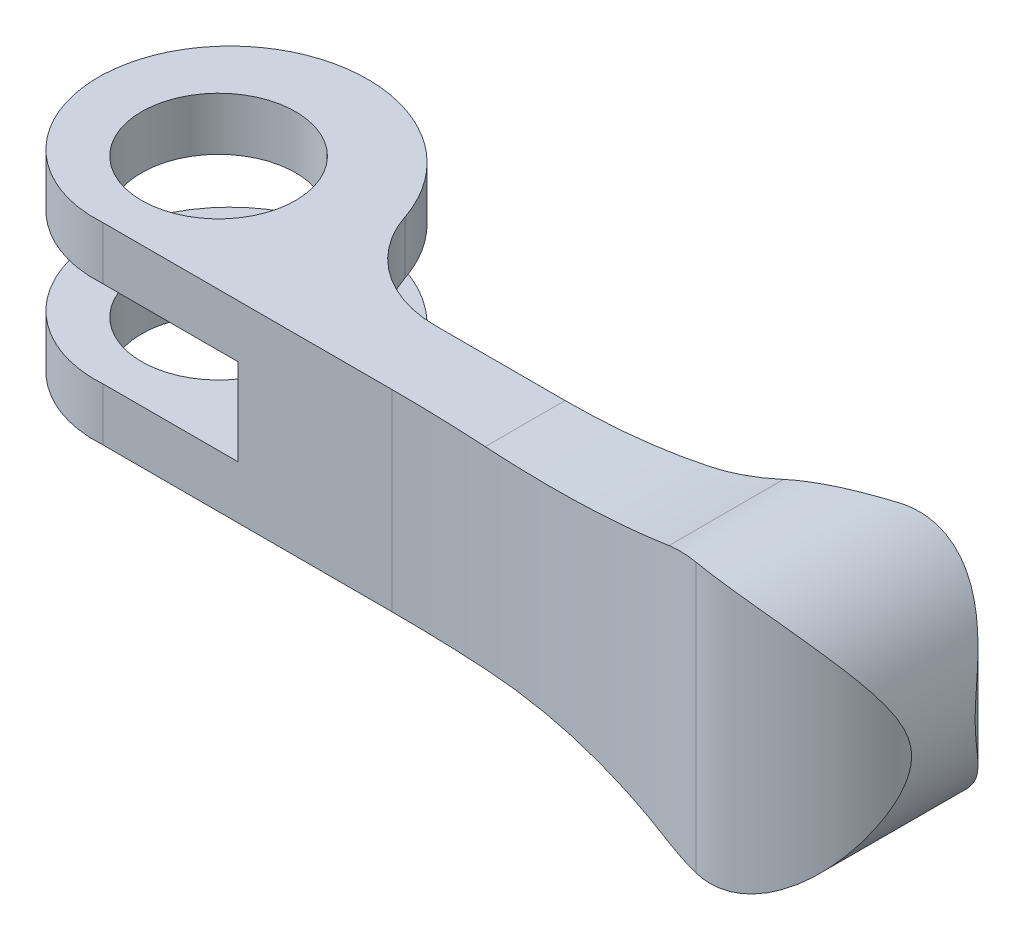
ISO-10303-21;
HEADER;
FILE_DESCRIPTION(('STEP AP214'),'2;1');
FILE_NAME('part.step','',(''),(''),'','','');
FILE_SCHEMA(('AUTOMOTIVE_DESIGN { 1 0 10303 214 1 1 1 1 }'));
ENDSEC;
DATA;
#1=APPLICATION_CONTEXT('core data for automotive mechanical design processes');
#2=APPLICATION_PROTOCOL_DEFINITION('international standard','automotive_design',2000,#1);
#3=PRODUCT_CONTEXT('',#1,'mechanical');
#4=PRODUCT('Part','Part','',(#3));
#5=PRODUCT_RELATED_PRODUCT_CATEGORY('part','',(#4));
#6=PRODUCT_DEFINITION_FORMATION('','',#4);
#7=PRODUCT_DEFINITION_CONTEXT('part definition',#1,'design');
#8=PRODUCT_DEFINITION('design','',#6,#7);
#9=PRODUCT_DEFINITION_SHAPE('','',#8);
#10=(LENGTH_UNIT() NAMED_UNIT(*) SI_UNIT(.MILLI.,.METRE.));
#11=(NAMED_UNIT(*) PLANE_ANGLE_UNIT() SI_UNIT($,.RADIAN.));
#12=(NAMED_UNIT(*) SI_UNIT($,.STERADIAN.) SOLID_ANGLE_UNIT());
#13=UNCERTAINTY_MEASURE_WITH_UNIT(LENGTH_MEASURE(1.E-05),#10,'distance_accuracy_value','');
#14=(GEOMETRIC_REPRESENTATION_CONTEXT(3) GLOBAL_UNCERTAINTY_ASSIGNED_CONTEXT((#13)) GLOBAL_UNIT_ASSIGNED_CONTEXT((#10,
#11,#12)) REPRESENTATION_CONTEXT('',''));
#15=CARTESIAN_POINT('',(0.,0.,0.));
#16=DIRECTION('',(0.,0.,1.));
#17=DIRECTION('',(1.,0.,0.));
#18=AXIS2_PLACEMENT_3D('',#15,#16,#17);
#19=CARTESIAN_POINT('',(37.,6.792418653,2.5));
#20=DIRECTION('',(0.,1.,0.));
#21=DIRECTION('',(1.,0.,0.));
#22=AXIS2_PLACEMENT_3D('',#19,#20,#21);
#23=CYLINDRICAL_SURFACE('',#22,3.5);
#24=DIRECTION('',(0.,-1.,0.));
#25=VECTOR('',#24,1.);
#26=CARTESIAN_POINT('',(34.9876414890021,-0.0049914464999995,-0.363636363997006));
#27=LINE('',#26,#25);
#28=CARTESIAN_POINT('',(34.9876414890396,6.71187613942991,-0.363636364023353));
#29=VERTEX_POINT('',#28);
#30=CARTESIAN_POINT('',(34.9876414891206,-6.7118761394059,-0.363636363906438));
#31=VERTEX_POINT('',#30);
#32=EDGE_CURVE('E137',#29,#31,#27,.T.);
#33=ORIENTED_EDGE('',*,*,#32,.F.);
#34=CARTESIAN_POINT('',(34.9876414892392,-6.71187613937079,-0.363636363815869));
#35=CARTESIAN_POINT('',(35.0647253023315,-6.68906330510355,-0.41783045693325));
#36=CARTESIAN_POINT('',(35.1436131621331,-6.66424326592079,-0.468592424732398));
#37=CARTESIAN_POINT('',(35.3040899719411,-6.61046716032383,-0.563089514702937));
#38=CARTESIAN_POINT('',(35.3856776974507,-6.58151294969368,-0.606827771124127));
#39=CARTESIAN_POINT('',(35.5501947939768,-6.51952376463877,-0.686909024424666));
#40=CARTESIAN_POINT('',(35.633112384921,-6.48651581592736,-0.723297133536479));
#41=CARTESIAN_POINT('',(35.7999170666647,-6.41628198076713,-0.789049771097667));
#42=CARTESIAN_POINT('',(35.8838042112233,-6.37905585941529,-0.818413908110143));
#43=CARTESIAN_POINT('',(36.1354603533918,-6.26123021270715,-0.896068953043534));
#44=CARTESIAN_POINT('',(36.303579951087,-6.17435167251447,-0.934091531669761));
#45=CARTESIAN_POINT('',(36.6350087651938,-5.98525304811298,-0.984969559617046));
#46=CARTESIAN_POINT('',(36.7983106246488,-5.88301082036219,-0.997788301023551));
#47=CARTESIAN_POINT('',(37.0655617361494,-5.69987252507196,-1.0010681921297));
#48=CARTESIAN_POINT('',(37.1719188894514,-5.6224808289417,-0.99732753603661));
#49=CARTESIAN_POINT('',(37.3796917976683,-5.4621912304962,-0.980904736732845));
#50=CARTESIAN_POINT('',(37.4811060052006,-5.37929162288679,-0.968219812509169));
#51=CARTESIAN_POINT('',(37.7772189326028,-5.12310549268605,-0.918480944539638));
#52=CARTESIAN_POINT('',(37.9636801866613,-4.942405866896,-0.869743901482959));
#53=CARTESIAN_POINT('',(38.2611556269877,-4.62097171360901,-0.767496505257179));
#54=CARTESIAN_POINT('',(38.3783160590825,-4.48394681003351,-0.719521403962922));
#55=CARTESIAN_POINT('',(38.6004038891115,-4.20326840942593,-0.615084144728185));
#56=CARTESIAN_POINT('',(38.7053269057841,-4.05961256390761,-0.558618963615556));
#57=CARTESIAN_POINT('',(38.9033172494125,-3.7659469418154,-0.439521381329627));
#58=CARTESIAN_POINT('',(38.9963366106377,-3.61591451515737,-0.376865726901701));
#59=CARTESIAN_POINT('',(39.1702113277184,-3.31049229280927,-0.248067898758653));
#60=CARTESIAN_POINT('',(39.2510705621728,-3.15510422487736,-0.181926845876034));
#61=CARTESIAN_POINT('',(39.4044023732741,-2.83147044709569,-0.045557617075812));
#62=CARTESIAN_POINT('',(39.4762879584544,-2.66296534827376,0.0247146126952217));
#63=CARTESIAN_POINT('',(39.6069834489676,-2.31980589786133,0.162765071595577));
#64=CARTESIAN_POINT('',(39.6657854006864,-2.14514788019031,0.230541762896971));
#65=CARTESIAN_POINT('',(39.7696772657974,-1.79037546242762,0.358591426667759));
#66=CARTESIAN_POINT('',(39.8148494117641,-1.61030129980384,0.418908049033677));
#67=CARTESIAN_POINT('',(39.8912183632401,-1.24341670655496,0.526367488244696));
#68=CARTESIAN_POINT('',(39.9224352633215,-1.05661638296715,0.573529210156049));
#69=CARTESIAN_POINT('',(39.9600231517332,-0.75544448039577,0.632132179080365));
#70=CARTESIAN_POINT('',(39.9713311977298,-0.642992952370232,0.650282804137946));
#71=CARTESIAN_POINT('',(39.9885110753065,-0.416631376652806,0.678167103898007));
#72=CARTESIAN_POINT('',(39.9943842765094,-0.302721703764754,0.687902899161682));
#73=CARTESIAN_POINT('',(40.000530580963,-0.0745821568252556,0.698097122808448));
#74=CARTESIAN_POINT('',(40.0008161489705,0.0396464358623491,0.698576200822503));
#75=CARTESIAN_POINT('',(39.9958109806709,0.267646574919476,0.69026566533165));
#76=CARTESIAN_POINT('',(39.9905195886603,0.381418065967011,0.681474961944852));
#77=CARTESIAN_POINT('',(39.9745697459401,0.60665107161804,0.655505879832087));
#78=CARTESIAN_POINT('',(39.9639552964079,0.718123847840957,0.638396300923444));
#79=CARTESIAN_POINT('',(39.937606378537,0.939157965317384,0.597089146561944));
#80=CARTESIAN_POINT('',(39.9218690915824,1.04871821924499,0.57288766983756));
#81=CARTESIAN_POINT('',(39.8671892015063,1.37495292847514,0.491653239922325));
#82=CARTESIAN_POINT('',(39.8208457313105,1.58827825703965,0.426116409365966));
#83=CARTESIAN_POINT('',(39.7125376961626,1.99608022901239,0.286496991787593));
#84=CARTESIAN_POINT('',(39.6513909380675,2.19097246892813,0.212947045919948));
#85=CARTESIAN_POINT('',(39.5129684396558,2.57344167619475,0.0616543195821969));
#86=CARTESIAN_POINT('',(39.4356798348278,2.76101266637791,-0.0160917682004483));
#87=CARTESIAN_POINT('',(39.2650664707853,3.12889763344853,-0.170716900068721));
#88=CARTESIAN_POINT('',(39.1717544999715,3.3092172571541,-0.247596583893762));
#89=CARTESIAN_POINT('',(38.9689261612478,3.66243054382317,-0.396405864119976));
#90=CARTESIAN_POINT('',(38.859420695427,3.83532910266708,-0.468338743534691));
#91=CARTESIAN_POINT('',(38.5796292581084,4.23647272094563,-0.628832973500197));
#92=CARTESIAN_POINT('',(38.401921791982,4.46125674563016,-0.713563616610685));
#93=CARTESIAN_POINT('',(38.1122101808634,4.78395341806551,-0.820175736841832));
#94=CARTESIAN_POINT('',(38.0118273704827,4.88906541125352,-0.852290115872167));
#95=CARTESIAN_POINT('',(37.8034912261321,5.09389611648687,-0.908228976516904));
#96=CARTESIAN_POINT('',(37.6955400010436,5.19361631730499,-0.932055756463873));
#97=CARTESIAN_POINT('',(37.4983893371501,5.36445280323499,-0.965423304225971));
#98=CARTESIAN_POINT('',(37.4106352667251,5.43684606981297,-0.976994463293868));
#99=CARTESIAN_POINT('',(37.2313130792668,5.57754128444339,-0.993507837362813));
#100=CARTESIAN_POINT('',(37.1397458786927,5.64584420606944,-0.998451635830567));
#101=CARTESIAN_POINT('',(36.9533574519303,5.77788891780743,-1.00092917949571));
#102=CARTESIAN_POINT('',(36.8585384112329,5.84163368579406,-0.998467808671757));
#103=CARTESIAN_POINT('',(36.666291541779,5.96416718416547,-0.985385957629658));
#104=CARTESIAN_POINT('',(36.5688641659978,6.02295676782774,-0.974766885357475));
#105=CARTESIAN_POINT('',(36.3869676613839,6.12680398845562,-0.946933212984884));
#106=CARTESIAN_POINT('',(36.3027335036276,6.17260184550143,-0.930938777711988));
#107=CARTESIAN_POINT('',(36.1337010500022,6.26010945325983,-0.892202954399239));
#108=CARTESIAN_POINT('',(36.0489028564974,6.30181992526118,-0.86946275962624));
#109=CARTESIAN_POINT('',(35.8795909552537,6.38096214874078,-0.817005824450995));
#110=CARTESIAN_POINT('',(35.7950770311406,6.41839883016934,-0.787297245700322));
#111=CARTESIAN_POINT('',(35.6270954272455,6.48896518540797,-0.720759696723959));
#112=CARTESIAN_POINT('',(35.5436273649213,6.52209647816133,-0.683933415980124));
#113=CARTESIAN_POINT('',(35.3797828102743,6.58362876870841,-0.603720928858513));
#114=CARTESIAN_POINT('',(35.2993789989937,6.61209161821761,-0.560438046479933));
#115=CARTESIAN_POINT('',(35.1412807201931,6.66497662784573,-0.467090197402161));
#116=CARTESIAN_POINT('',(35.0635849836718,6.68940070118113,-0.417028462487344));
#117=CARTESIAN_POINT('',(34.9876414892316,6.71187613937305,-0.363636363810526));
#118=B_SPLINE_CURVE_WITH_KNOTS('',3,(#34,#35,#36,#37,#38,#39,#40,#41,#42,#43,#44,#45,#46,#47,
#48,#49,#50,#51,#52,#53,#54,#55,#56,#57,#58,#59,#60,#61,#62,#63,#64,#65,#66,#67,#68,#69,#70,#71,
#72,#73,#74,#75,#76,#77,#78,#79,#80,#81,#82,#83,#84,#85,#86,#87,#88,#89,#90,#91,#92,#93,#94,#95,
#96,#97,#98,#99,#100,#101,#102,#103,#104,#105,#106,#107,#108,#109,#110,#111,#112,#113,#114,#115,
#116,#117),.UNSPECIFIED.,.F.,.F.,(4,2,2,2,2,2,2,2,2,2,2,2,2,2,2,2,2,2,2,2,2,2,2,2,2,2,2,2,2,2,2,
2,2,2,2,2,2,2,2,2,2,4),(0.,0.29073598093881,0.581341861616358,0.870105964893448,1.158886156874,
1.73521622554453,2.31238506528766,2.70663274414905,3.10100305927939,3.89013132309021,
4.4491684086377,5.00840503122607,5.56982852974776,6.13107257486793,6.71919138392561,
7.30766674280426,7.89251719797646,8.47652277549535,8.81954267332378,9.16247610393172,
9.50464443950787,9.84685300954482,10.1862783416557,10.5258907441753,11.2078324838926,
11.8583646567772,12.5094172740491,13.1599526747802,13.8100520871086,14.7030799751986,
15.1492263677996,15.5952489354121,15.9380021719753,16.2806735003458,16.6231188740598,
16.9655051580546,17.256817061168,17.5480774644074,17.8389984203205,18.1298096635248,
18.4163865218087,18.7028272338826),.UNSPECIFIED.);
#119=EDGE_CURVE('E192',#31,#29,#118,.T.);
#120=ORIENTED_EDGE('',*,*,#119,.F.);
#121=EDGE_LOOP('',(#33,#120));
#122=FACE_BOUND('',#121,.T.);
#123=ADVANCED_FACE('F14',(#122),#23,.T.);
#124=CARTESIAN_POINT('',(0.,5.,0.));
#125=DIRECTION('',(0.,-1.,0.));
#126=DIRECTION('',(0.,0.,1.));
#127=AXIS2_PLACEMENT_3D('',#124,#125,#126);
#128=CYLINDRICAL_SURFACE('',#127,4.);
#129=CARTESIAN_POINT('',(0.,5.,0.));
#130=DIRECTION('',(0.,-1.,0.));
#131=DIRECTION('',(0.,0.,1.));
#132=AXIS2_PLACEMENT_3D('',#129,#130,#131);
#133=CIRCLE('',#132,4.);
#134=CARTESIAN_POINT('',(0.,5.,4.));
#135=VERTEX_POINT('',#134);
#136=EDGE_CURVE('E233',#135,#135,#133,.T.);
#137=ORIENTED_EDGE('',*,*,#136,.F.);
#138=EDGE_LOOP('',(#137));
#139=FACE_BOUND('',#138,.T.);
#140=CARTESIAN_POINT('',(0.,2.25,0.));
#141=DIRECTION('',(0.,-1.,0.));
#142=DIRECTION('',(0.,0.,1.));
#143=AXIS2_PLACEMENT_3D('',#140,#141,#142);
#144=CIRCLE('',#143,4.);
#145=CARTESIAN_POINT('',(0.,2.25,4.));
#146=VERTEX_POINT('',#145);
#147=EDGE_CURVE('E272',#146,#146,#144,.F.);
#148=ORIENTED_EDGE('',*,*,#147,.F.);
#149=EDGE_LOOP('',(#148));
#150=FACE_BOUND('',#149,.T.);
#151=ADVANCED_FACE('F202',(#139,#150),#128,.F.);
#152=CARTESIAN_POINT('',(13.268831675,2.25,-4.));
#153=DIRECTION('',(0.,1.,0.));
#154=DIRECTION('',(1.,0.,0.));
#155=AXIS2_PLACEMENT_3D('',#152,#153,#154);
#156=CYLINDRICAL_SURFACE('',#155,6.);
#157=CARTESIAN_POINT('',(13.268831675,2.2500000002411,-4.));
#158=DIRECTION('',(0.,1.,0.));
#159=DIRECTION('',(1.,0.,0.));
#160=AXIS2_PLACEMENT_3D('',#157,#158,#159);
#161=CIRCLE('',#160,6.);
#162=CARTESIAN_POINT('',(7.57871796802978,2.25000000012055,-2.09668552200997));
#163=VERTEX_POINT('',#162);
#164=CARTESIAN_POINT('',(13.268831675,2.25000000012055,2.));
#165=VERTEX_POINT('',#164);
#166=EDGE_CURVE('E245',#163,#165,#161,.T.);
#167=ORIENTED_EDGE('',*,*,#166,.F.);
#168=DIRECTION('',(0.,1.,0.));
#169=VECTOR('',#168,1.);
#170=CARTESIAN_POINT('',(7.578717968,3.625,-2.096685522));
#171=LINE('',#170,#169);
#172=CARTESIAN_POINT('',(7.57871796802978,5.00000000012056,-2.09668552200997));
#173=VERTEX_POINT('',#172);
#174=EDGE_CURVE('E244',#173,#163,#171,.F.);
#175=ORIENTED_EDGE('',*,*,#174,.F.);
#176=CARTESIAN_POINT('',(13.268831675,5.00000000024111,-4.));
#177=DIRECTION('',(0.,1.,0.));
#178=DIRECTION('',(1.,0.,0.));
#179=AXIS2_PLACEMENT_3D('',#176,#177,#178);
#180=CIRCLE('',#179,6.);
#181=CARTESIAN_POINT('',(13.268831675,5.00000000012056,2.));
#182=VERTEX_POINT('',#181);
#183=EDGE_CURVE('E229',#182,#173,#180,.F.);
#184=ORIENTED_EDGE('',*,*,#183,.F.);
#185=DIRECTION('',(0.,-1.,0.));
#186=VECTOR('',#185,1.);
#187=CARTESIAN_POINT('',(13.268831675,-7.,2.));
#188=LINE('',#187,#186);
#189=EDGE_CURVE('E333',#165,#182,#188,.F.);
#190=ORIENTED_EDGE('',*,*,#189,.F.);
#191=EDGE_LOOP('',(#167,#175,#184,#190));
#192=FACE_BOUND('',#191,.T.);
#193=ADVANCED_FACE('F206',(#192),#156,.F.);
#194=CARTESIAN_POINT('',(27.513167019,-7.08474618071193,-11.));
#195=DIRECTION('',(0.,1.,0.));
#196=DIRECTION('',(1.,0.,0.));
#197=AXIS2_PLACEMENT_3D('',#194,#195,#196);
#198=CYLINDRICAL_SURFACE('',#197,13.);
#199=CARTESIAN_POINT('',(34.9876414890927,6.71187613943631,-0.363636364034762));
#200=CARTESIAN_POINT('',(34.8187103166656,6.76191117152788,-0.24489193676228));
#201=CARTESIAN_POINT('',(34.6457083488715,6.80619685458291,-0.129362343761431));
#202=CARTESIAN_POINT('',(34.2921746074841,6.88207709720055,0.0945349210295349));
#203=CARTESIAN_POINT('',(34.1116346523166,6.91365744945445,0.202894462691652));
#204=CARTESIAN_POINT('',(33.7491024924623,6.96213743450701,0.408565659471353));
#205=CARTESIAN_POINT('',(33.5672886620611,6.97941906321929,0.506100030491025));
#206=CARTESIAN_POINT('',(33.1986366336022,6.99961375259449,0.69264987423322));
#207=CARTESIAN_POINT('',(33.0118009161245,7.00253378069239,0.781669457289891));
#208=CARTESIAN_POINT('',(32.6668262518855,6.99381458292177,0.936043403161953));
#209=CARTESIAN_POINT('',(32.5092671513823,6.98458871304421,1.00283690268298));
#210=CARTESIAN_POINT('',(32.1925327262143,6.95509121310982,1.12982479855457));
#211=CARTESIAN_POINT('',(32.0333575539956,6.9348206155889,1.19001981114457));
#212=CARTESIAN_POINT('',(31.7107197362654,6.88222774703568,1.30489732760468));
#213=CARTESIAN_POINT('',(31.547243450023,6.84963623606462,1.35941912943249));
#214=CARTESIAN_POINT('',(31.2208467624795,6.7722123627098,1.46124185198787));
#215=CARTESIAN_POINT('',(31.0579267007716,6.72737353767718,1.50853893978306));
#216=CARTESIAN_POINT('',(30.8959537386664,6.67630057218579,1.55216132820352));
#217=B_SPLINE_CURVE_WITH_KNOTS('',3,(#199,#200,#201,#202,#203,#204,#205,#206,#207,#208,#209,
#210,#211,#212,#213,#214,#215,#216),.UNSPECIFIED.,.F.,.F.,(4,2,2,2,2,2,2,2,4),(0.,
0.63738668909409,1.27548414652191,1.89592745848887,2.51606973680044,3.02975110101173,
3.54338445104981,4.06895959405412,4.59481260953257),.UNSPECIFIED.);
#218=CARTESIAN_POINT('',(30.8959537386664,6.67630057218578,1.55216132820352));
#219=VERTEX_POINT('',#218);
#220=EDGE_CURVE('E186',#29,#219,#217,.T.);
#221=ORIENTED_EDGE('',*,*,#220,.F.);
#222=ORIENTED_EDGE('',*,*,#32,.T.);
#223=CARTESIAN_POINT('',(30.8959537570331,-6.67630057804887,1.55216132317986));
#224=CARTESIAN_POINT('',(30.9878260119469,-6.70525531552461,1.52740340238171));
#225=CARTESIAN_POINT('',(31.0799954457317,-6.7322164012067,1.50148006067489));
#226=CARTESIAN_POINT('',(31.2647133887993,-6.78217764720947,1.44729526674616));
#227=CARTESIAN_POINT('',(31.3572618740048,-6.80517805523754,1.4190339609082));
#228=CARTESIAN_POINT('',(31.6349937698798,-6.86824278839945,1.33078343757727));
#229=CARTESIAN_POINT('',(31.8204395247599,-6.90242569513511,1.26728045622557));
#230=CARTESIAN_POINT('',(32.1854427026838,-6.95482927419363,1.13287809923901));
#231=CARTESIAN_POINT('',(32.3650305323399,-6.97343136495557,1.06220609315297));
#232=CARTESIAN_POINT('',(32.7216346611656,-6.99674470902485,0.912566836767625));
#233=CARTESIAN_POINT('',(32.8986508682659,-7.00145546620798,0.833599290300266));
#234=CARTESIAN_POINT('',(33.2404618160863,-6.9978558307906,0.671851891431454));
#235=CARTESIAN_POINT('',(33.4054362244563,-6.99015725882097,0.589434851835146));
#236=CARTESIAN_POINT('',(33.7310414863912,-6.963638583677,0.418051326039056));
#237=CARTESIAN_POINT('',(33.8916718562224,-6.94481724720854,0.329084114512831));
#238=CARTESIAN_POINT('',(34.2118143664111,-6.8962579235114,0.142856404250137));
#239=CARTESIAN_POINT('',(34.3711979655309,-6.866258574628,0.0454440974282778));
#240=CARTESIAN_POINT('',(34.6839990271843,-6.79630968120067,-0.155012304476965));
#241=CARTESIAN_POINT('',(34.8374201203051,-6.7563663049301,-0.258052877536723));
#242=CARTESIAN_POINT('',(34.9876414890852,-6.7118761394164,-0.363636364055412));
#243=B_SPLINE_CURVE_WITH_KNOTS('',3,(#223,#224,#225,#226,#227,#228,#229,#230,#231,#232,#233,
#234,#235,#236,#237,#238,#239,#240,#241,#242),.UNSPECIFIED.,.F.,.F.,(4,2,2,2,2,2,2,2,2,4),(0.,
0.298315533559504,0.59661240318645,1.19263756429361,1.77360614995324,2.35459548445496,
2.90780553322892,3.4610769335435,4.02819169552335,4.59495554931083),.UNSPECIFIED.);
#244=CARTESIAN_POINT('',(30.8959537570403,-6.67630057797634,1.5521613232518));
#245=VERTEX_POINT('',#244);
#246=EDGE_CURVE('E136',#245,#31,#243,.T.);
#247=ORIENTED_EDGE('',*,*,#246,.F.);
#248=CARTESIAN_POINT('',(27.5131670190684,-5.7871346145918,2.));
#249=CARTESIAN_POINT('',(27.8021879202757,-5.84834615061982,2.00001639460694));
#250=CARTESIAN_POINT('',(28.0904268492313,-5.91312456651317,1.99036227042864));
#251=CARTESIAN_POINT('',(28.6627625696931,-6.0490795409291,1.9522276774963));
#252=CARTESIAN_POINT('',(28.9468721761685,-6.12022594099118,1.92383227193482));
#253=CARTESIAN_POINT('',(29.5109884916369,-6.2687379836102,1.84872338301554));
#254=CARTESIAN_POINT('',(29.7909953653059,-6.34610337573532,1.80201063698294));
#255=CARTESIAN_POINT('',(30.3470640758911,-6.50686821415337,1.69054250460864));
#256=CARTESIAN_POINT('',(30.6231023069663,-6.59029339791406,1.62570637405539));
#257=CARTESIAN_POINT('',(30.8959537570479,-6.67630057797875,1.55216132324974));
#258=B_SPLINE_CURVE_WITH_KNOTS('',3,(#248,#249,#250,#251,#252,#253,#254,#255,#256,#257),
.UNSPECIFIED.,.F.,.F.,(4,2,2,2,4),(0.,0.886077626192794,1.76816091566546,2.65020870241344,
3.53625064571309),.UNSPECIFIED.);
#259=CARTESIAN_POINT('',(27.5131670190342,-5.78713461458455,2.));
#260=VERTEX_POINT('',#259);
#261=EDGE_CURVE('E217',#260,#245,#258,.T.);
#262=ORIENTED_EDGE('',*,*,#261,.F.);
#263=DIRECTION('',(0.,-1.,0.));
#264=VECTOR('',#263,1.);
#265=CARTESIAN_POINT('',(27.513167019,-7.,2.));
#266=LINE('',#265,#264);
#267=CARTESIAN_POINT('',(27.5131670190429,5.78713461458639,2.));
#268=VERTEX_POINT('',#267);
#269=EDGE_CURVE('E278',#268,#260,#266,.T.);
#270=ORIENTED_EDGE('',*,*,#269,.F.);
#271=CARTESIAN_POINT('',(30.8959537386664,6.67630057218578,1.55216132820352));
#272=CARTESIAN_POINT('',(30.623102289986,6.59029339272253,1.62570637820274));
#273=CARTESIAN_POINT('',(30.3470640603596,6.50686820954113,1.69054250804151));
#274=CARTESIAN_POINT('',(29.7909953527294,6.34610337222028,1.80201063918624));
#275=CARTESIAN_POINT('',(29.510988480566,6.26873798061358,1.84872338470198));
#276=CARTESIAN_POINT('',(28.9468721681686,6.12022593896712,1.92383227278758));
#277=CARTESIAN_POINT('',(28.6627625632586,6.04907953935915,1.95222767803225));
#278=CARTESIAN_POINT('',(28.0904268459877,5.91312456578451,1.9903622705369));
#279=CARTESIAN_POINT('',(27.802187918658,5.84834615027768,2.0000163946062));
#280=CARTESIAN_POINT('',(27.5131670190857,5.78713461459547,2.));
#281=B_SPLINE_CURVE_WITH_KNOTS('',3,(#271,#272,#273,#274,#275,#276,#277,#278,#279,#280),
.UNSPECIFIED.,.F.,.F.,(4,2,2,2,4),(0.,0.886041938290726,1.76808972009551,2.65017300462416,
3.53625062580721),.UNSPECIFIED.);
#282=EDGE_CURVE('E223',#219,#268,#281,.T.);
#283=ORIENTED_EDGE('',*,*,#282,.F.);
#284=EDGE_LOOP('',(#221,#222,#247,#262,#270,#283));
#285=FACE_BOUND('',#284,.T.);
#286=ADVANCED_FACE('F209',(#285),#198,.F.);
#287=CARTESIAN_POINT('',(34.,7.09416103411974,1.5));
#288=DIRECTION('',(0.,1.,0.));
#289=DIRECTION('',(1.,0.,0.));
#290=AXIS2_PLACEMENT_3D('',#287,#288,#289);
#291=CYLINDRICAL_SURFACE('',#290,6.5);
#292=CARTESIAN_POINT('',(32.6465753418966,6.99107223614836,7.85753424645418));
#293=CARTESIAN_POINT('',(32.7851306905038,6.99810811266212,7.88706262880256));
#294=CARTESIAN_POINT('',(32.9248731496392,7.00101267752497,7.9120457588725));
#295=CARTESIAN_POINT('',(33.2055895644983,6.99837943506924,7.95282230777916));
#296=CARTESIAN_POINT('',(33.3465633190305,6.992842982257,7.96861720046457));
#297=CARTESIAN_POINT('',(33.6278383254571,6.97320662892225,7.99086382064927));
#298=CARTESIAN_POINT('',(33.7681388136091,6.95915587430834,7.99736845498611));
#299=CARTESIAN_POINT('',(34.0477501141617,6.92257843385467,8.00132775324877));
#300=CARTESIAN_POINT('',(34.1870609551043,6.9000519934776,7.99878267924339));
#301=CARTESIAN_POINT('',(34.4635957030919,6.84673014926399,7.98492426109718));
#302=CARTESIAN_POINT('',(34.6008202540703,6.81593735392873,7.97361368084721));
#303=CARTESIAN_POINT('',(34.8723366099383,6.74640689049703,7.9426477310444));
#304=CARTESIAN_POINT('',(35.0066270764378,6.70766567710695,7.92298863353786));
#305=CARTESIAN_POINT('',(35.2714938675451,6.62266369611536,7.87584588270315));
#306=CARTESIAN_POINT('',(35.4020675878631,6.57639780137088,7.84835688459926));
#307=CARTESIAN_POINT('',(35.6587673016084,6.47687574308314,7.78617079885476));
#308=CARTESIAN_POINT('',(35.784892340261,6.42361809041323,7.75147217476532));
#309=CARTESIAN_POINT('',(36.0662400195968,6.29509423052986,7.66505072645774));
#310=CARTESIAN_POINT('',(36.2199138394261,6.21780553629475,7.61127097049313));
#311=CARTESIAN_POINT('',(36.5184476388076,6.05388891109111,7.49442729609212));
#312=CARTESIAN_POINT('',(36.663305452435,5.96725869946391,7.43136110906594));
#313=CARTESIAN_POINT('',(37.0844326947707,5.69466533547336,7.23001336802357));
#314=CARTESIAN_POINT('',(37.347012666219,5.49611309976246,7.07966091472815));
#315=CARTESIAN_POINT('',(37.7546488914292,5.14205630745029,6.8095690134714));
#316=CARTESIAN_POINT('',(37.9101327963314,4.99358591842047,6.69580234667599));
#317=CARTESIAN_POINT('',(38.2042699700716,4.68623105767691,6.46079490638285));
#318=CARTESIAN_POINT('',(38.3429248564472,4.52734758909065,6.33955485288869));
#319=CARTESIAN_POINT('',(38.603940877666,4.19997335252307,6.09196642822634));
#320=CARTESIAN_POINT('',(38.7262757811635,4.03146772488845,5.96561024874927));
#321=CARTESIAN_POINT('',(38.954789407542,3.68557290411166,5.7106203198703));
#322=CARTESIAN_POINT('',(39.060973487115,3.50818668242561,5.58198734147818));
#323=CARTESIAN_POINT('',(39.2320671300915,3.19136718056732,5.35873373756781));
#324=CARTESIAN_POINT('',(39.3005488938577,3.05398352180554,5.26392076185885));
#325=CARTESIAN_POINT('',(39.4288419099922,2.77376130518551,5.07639074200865));
#326=CARTESIAN_POINT('',(39.4886511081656,2.63092146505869,4.98367419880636));
#327=CARTESIAN_POINT('',(39.5993455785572,2.33942487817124,4.80280718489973));
#328=CARTESIAN_POINT('',(39.650248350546,2.19078025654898,4.71464800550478));
#329=CARTESIAN_POINT('',(39.7428820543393,1.88648083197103,4.546069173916));
#330=CARTESIAN_POINT('',(39.7846203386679,1.73083177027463,4.4656433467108));
#331=CARTESIAN_POINT('',(39.8588709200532,1.4084604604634,4.31614810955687));
#332=CARTESIAN_POINT('',(39.8912110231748,1.24159318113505,4.24729935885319));
#333=CARTESIAN_POINT('',(39.9441891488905,0.898898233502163,4.13073952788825));
#334=CARTESIAN_POINT('',(39.9648619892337,0.723098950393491,4.08296564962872));
#335=CARTESIAN_POINT('',(39.9859284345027,0.452977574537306,4.03356997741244));
#336=CARTESIAN_POINT('',(39.991295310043,0.361049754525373,4.02080503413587));
#337=CARTESIAN_POINT('',(39.9983904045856,0.176252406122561,4.0038776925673));
#338=CARTESIAN_POINT('',(40.0001192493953,0.0833830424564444,3.99971381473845));
#339=CARTESIAN_POINT('',(39.9998679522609,-0.102313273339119,4.00031690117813));
#340=CARTESIAN_POINT('',(39.9978881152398,-0.1951402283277,4.00508313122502));
#341=CARTESIAN_POINT('',(39.9903014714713,-0.379796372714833,4.02316810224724));
#342=CARTESIAN_POINT('',(39.9846938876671,-0.471625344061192,4.03648867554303));
#343=CARTESIAN_POINT('',(39.9606833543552,-0.769261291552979,4.09269847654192));
#344=CARTESIAN_POINT('',(39.9350773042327,-0.971501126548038,4.15164766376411));
#345=CARTESIAN_POINT('',(39.8687117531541,-1.36418123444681,4.2954215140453));
#346=CARTESIAN_POINT('',(39.8278764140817,-1.55455679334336,4.38037528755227));
#347=CARTESIAN_POINT('',(39.7322889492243,-1.92709802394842,4.56626921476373));
#348=CARTESIAN_POINT('',(39.6773415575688,-2.10910240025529,4.66742549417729));
#349=CARTESIAN_POINT('',(39.5547002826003,-2.46397848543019,4.87789620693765));
#350=CARTESIAN_POINT('',(39.4869940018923,-2.63684110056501,4.98721851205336));
#351=CARTESIAN_POINT('',(39.3390916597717,-2.97489005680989,5.20971620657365));
#352=CARTESIAN_POINT('',(39.2588793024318,-3.14006601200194,5.32289647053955));
#353=CARTESIAN_POINT('',(39.0860582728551,-3.46315413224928,5.54998524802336));
#354=CARTESIAN_POINT('',(38.9934541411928,-3.62106892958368,5.66389348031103));
#355=CARTESIAN_POINT('',(38.783620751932,-3.94867363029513,5.90401993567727));
#356=CARTESIAN_POINT('',(38.6647666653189,-4.11746401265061,6.03005284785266));
#357=CARTESIAN_POINT('',(38.4107973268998,-4.44593964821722,6.27769329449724));
#358=CARTESIAN_POINT('',(38.2756775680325,-4.60562235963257,6.39929959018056));
#359=CARTESIAN_POINT('',(37.9891321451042,-4.91455001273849,6.63528663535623));
#360=CARTESIAN_POINT('',(37.8377479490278,-5.06381997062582,6.7496846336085));
#361=CARTESIAN_POINT('',(37.5182179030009,-5.35087651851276,6.96897975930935));
#362=CARTESIAN_POINT('',(37.3500746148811,-5.48866485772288,7.07387833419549));
#363=CARTESIAN_POINT('',(36.9333079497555,-5.79812797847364,7.30699523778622));
#364=CARTESIAN_POINT('',(36.6774528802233,-5.96422556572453,7.43007861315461));
#365=CARTESIAN_POINT('',(36.2718987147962,-6.190210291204,7.59177503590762));
#366=CARTESIAN_POINT('',(36.1330492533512,-6.26169271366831,7.64186172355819));
#367=CARTESIAN_POINT('',(35.848553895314,-6.39612794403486,7.73338923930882));
#368=CARTESIAN_POINT('',(35.7029109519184,-6.45908441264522,7.77483378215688));
#369=CARTESIAN_POINT('',(35.4039328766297,-6.57625789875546,7.84845914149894));
#370=CARTESIAN_POINT('',(35.2505312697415,-6.63037232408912,7.88053420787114));
#371=CARTESIAN_POINT('',(34.9386719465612,-6.7281671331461,7.93380890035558));
#372=CARTESIAN_POINT('',(34.7802171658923,-6.77185345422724,7.95501472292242));
#373=CARTESIAN_POINT('',(34.4596848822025,-6.84809642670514,7.98572107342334));
#374=CARTESIAN_POINT('',(34.297611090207,-6.8806639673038,7.99523307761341));
#375=CARTESIAN_POINT('',(33.9713963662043,-6.9342412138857,8.00198335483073));
#376=CARTESIAN_POINT('',(33.8072565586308,-6.95525695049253,7.9992280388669));
#377=CARTESIAN_POINT('',(33.4759413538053,-6.98581220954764,7.98099541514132));
#378=CARTESIAN_POINT('',(33.3087591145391,-6.99516435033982,7.96531694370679));
#379=CARTESIAN_POINT('',(33.059216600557,-7.00024506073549,7.93210563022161));
#380=CARTESIAN_POINT('',(32.9762514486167,-7.00044792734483,7.91942183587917));
#381=CARTESIAN_POINT('',(32.8109180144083,-6.99793423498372,7.89086235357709));
#382=CARTESIAN_POINT('',(32.7285497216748,-6.99521772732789,7.87498672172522));
#383=CARTESIAN_POINT('',(32.6465753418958,-6.99107223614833,7.85753424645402));
#384=B_SPLINE_CURVE_WITH_KNOTS('',3,(#292,#293,#294,#295,#296,#297,#298,#299,#300,#301,#302,
#303,#304,#305,#306,#307,#308,#309,#310,#311,#312,#313,#314,#315,#316,#317,#318,#319,#320,#321,
#322,#323,#324,#325,#326,#327,#328,#329,#330,#331,#332,#333,#334,#335,#336,#337,#338,#339,#340,
#341,#342,#343,#344,#345,#346,#347,#348,#349,#350,#351,#352,#353,#354,#355,#356,#357,#358,#359,
#360,#361,#362,#363,#364,#365,#366,#367,#368,#369,#370,#371,#372,#373,#374,#375,#376,#377,#378,
#379,#380,#381,#382,#383),.UNSPECIFIED.,.F.,.F.,(4,2,2,2,2,2,2,2,2,2,2,2,2,2,2,2,2,2,2,2,2,2,2,
2,2,2,2,2,2,2,2,2,2,2,2,2,2,2,2,2,2,2,2,2,2,4),(0.,0.425402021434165,0.850735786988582,
1.27363753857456,1.6965270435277,2.11928325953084,2.54222845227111,2.9654630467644,
3.38878792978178,3.92865795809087,4.46866009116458,5.54949299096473,6.27839535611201,
7.00722760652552,7.73721755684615,8.46696486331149,9.0079760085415,9.54911508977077,
10.0891786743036,10.6288073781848,11.1777763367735,11.7250982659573,12.0035788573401,
12.2820115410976,12.5604213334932,12.8388907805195,13.4715020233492,14.107306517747,
14.7524330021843,15.3981895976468,16.0447947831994,16.6911636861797,17.4160425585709,
18.1411227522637,18.8643962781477,19.5875594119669,20.5701615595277,21.0616999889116,
21.55302669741,22.0497016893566,22.5460932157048,23.0419971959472,23.5376420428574,
24.041151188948,24.2928413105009,24.5445270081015),.UNSPECIFIED.);
#385=CARTESIAN_POINT('',(32.6465753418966,6.99107223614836,7.85753424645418));
#386=VERTEX_POINT('',#385);
#387=CARTESIAN_POINT('',(32.6465753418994,-6.99107223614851,7.85753424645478));
#388=VERTEX_POINT('',#387);
#389=EDGE_CURVE('E18',#386,#388,#384,.T.);
#390=ORIENTED_EDGE('',*,*,#389,.F.);
#391=DIRECTION('',(0.,1.,0.));
#392=VECTOR('',#391,1.);
#393=CARTESIAN_POINT('',(32.6465753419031,0.,7.85753424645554));
#394=LINE('',#393,#392);
#395=EDGE_CURVE('E138',#388,#386,#394,.T.);
#396=ORIENTED_EDGE('',*,*,#395,.F.);
#397=EDGE_LOOP('',(#390,#396));
#398=FACE_BOUND('',#397,.T.);
#399=ADVANCED_FACE('F139',(#398),#291,.T.);
#400=CARTESIAN_POINT('',(33.,0.,8.06009783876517));
#401=DIRECTION('',(0.,0.,1.));
#402=DIRECTION('',(0.,1.,0.));
#403=AXIS2_PLACEMENT_3D('',#400,#401,#402);
#404=CYLINDRICAL_SURFACE('',#403,7.);
#405=DIRECTION('',(0.,0.,-1.));
#406=VECTOR('',#405,1.);
#407=CARTESIAN_POINT('',(30.8959538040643,6.67630059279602,4.5281268));
#408=LINE('',#407,#406);
#409=CARTESIAN_POINT('',(30.8959538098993,6.67630059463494,7.50409227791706));
#410=VERTEX_POINT('',#409);
#411=EDGE_CURVE('E230',#410,#219,#408,.T.);
#412=ORIENTED_EDGE('',*,*,#411,.F.);
#413=CARTESIAN_POINT('',(32.6465753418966,6.99107223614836,7.85753424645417));
#414=CARTESIAN_POINT('',(32.4982646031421,6.98358037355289,7.82595894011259));
#415=CARTESIAN_POINT('',(32.3500956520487,6.97135252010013,7.7948342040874));
#416=CARTESIAN_POINT('',(32.0552147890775,6.93752830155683,7.73370856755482));
#417=CARTESIAN_POINT('',(31.9084994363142,6.91596904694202,7.70370372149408));
#418=CARTESIAN_POINT('',(31.6165198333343,6.86352551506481,7.64478986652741));
#419=CARTESIAN_POINT('',(31.4712555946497,6.83264116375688,7.61588086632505));
#420=CARTESIAN_POINT('',(31.1821978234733,6.7614982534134,7.55913008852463));
#421=CARTESIAN_POINT('',(31.0384123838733,6.72120308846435,7.53129298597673));
#422=CARTESIAN_POINT('',(30.8959538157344,6.67630059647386,7.50409227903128));
#423=B_SPLINE_CURVE_WITH_KNOTS('',3,(#413,#414,#415,#416,#417,#418,#419,#420,#421,#422),
.UNSPECIFIED.,.F.,.F.,(4,2,2,2,4),(0.,0.455386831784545,0.908979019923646,1.36257480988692,
1.81796526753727),.UNSPECIFIED.);
#424=EDGE_CURVE('E134',#386,#410,#423,.T.);
#425=ORIENTED_EDGE('',*,*,#424,.F.);
#426=ORIENTED_EDGE('',*,*,#389,.T.);
#427=CARTESIAN_POINT('',(30.8959537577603,-6.67630057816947,7.50409226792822));
#428=CARTESIAN_POINT('',(31.0384123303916,-6.7212030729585,7.53129297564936));
#429=CARTESIAN_POINT('',(31.1821977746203,-6.76149824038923,7.55913007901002));
#430=CARTESIAN_POINT('',(31.4712555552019,-6.83264115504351,7.61588085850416));
#431=CARTESIAN_POINT('',(31.6165197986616,-6.86352550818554,7.64478985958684));
#432=CARTESIAN_POINT('',(31.9084994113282,-6.91596904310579,7.70370371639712));
#433=CARTESIAN_POINT('',(32.0552147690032,-6.93752829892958,7.73370856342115));
#434=CARTESIAN_POINT('',(32.3500956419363,-6.97135251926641,7.79483420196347));
#435=CARTESIAN_POINT('',(32.4982645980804,-6.98358037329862,7.82595893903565));
#436=CARTESIAN_POINT('',(32.6465753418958,-6.99107223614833,7.85753424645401));
#437=B_SPLINE_CURVE_WITH_KNOTS('',3,(#427,#428,#429,#430,#431,#432,#433,#434,#435,#436),
.UNSPECIFIED.,.F.,.F.,(4,2,2,2,4),(0.,0.455390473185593,0.908986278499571,1.36257848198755,
1.81796532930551),.UNSPECIFIED.);
#438=CARTESIAN_POINT('',(30.8959537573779,-6.67630057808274,7.504092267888));
#439=VERTEX_POINT('',#438);
#440=EDGE_CURVE('E131',#439,#388,#437,.T.);
#441=ORIENTED_EDGE('',*,*,#440,.F.);
#442=DIRECTION('',(0.,0.,1.));
#443=VECTOR('',#442,1.);
#444=CARTESIAN_POINT('',(30.8959537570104,-6.67630057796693,4.528126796));
#445=LINE('',#444,#443);
#446=EDGE_CURVE('E146',#245,#439,#445,.T.);
#447=ORIENTED_EDGE('',*,*,#446,.F.);
#448=ORIENTED_EDGE('',*,*,#246,.T.);
#449=ORIENTED_EDGE('',*,*,#119,.T.);
#450=ORIENTED_EDGE('',*,*,#220,.T.);
#451=EDGE_LOOP('',(#412,#425,#426,#441,#447,#448,#449,#450));
#452=FACE_BOUND('',#451,.T.);
#453=ADVANCED_FACE('F128',(#452),#404,.T.);
#454=CARTESIAN_POINT('',(20.,41.25,1.516449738));
#455=DIRECTION('',(0.,0.,1.));
#456=DIRECTION('',(0.,1.,0.));
#457=AXIS2_PLACEMENT_3D('',#454,#455,#456);
#458=CYLINDRICAL_SURFACE('',#457,36.25);
#459=DIRECTION('',(0.,0.,-1.));
#460=VECTOR('',#459,1.);
#461=CARTESIAN_POINT('',(20.,5.,-14.));
#462=LINE('',#461,#460);
#463=CARTESIAN_POINT('',(20.,5.,6.14762119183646));
#464=VERTEX_POINT('',#463);
#465=CARTESIAN_POINT('',(20.,5.,2.));
#466=VERTEX_POINT('',#465);
#467=EDGE_CURVE('E232',#464,#466,#462,.T.);
#468=ORIENTED_EDGE('',*,*,#467,.F.);
#469=CARTESIAN_POINT('',(30.8959538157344,6.67630059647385,7.50409227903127));
#470=CARTESIAN_POINT('',(30.4583077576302,6.5383751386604,7.42051954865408));
#471=CARTESIAN_POINT('',(30.0175613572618,6.40861021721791,7.33993964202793));
#472=CARTESIAN_POINT('',(29.130409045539,6.16567756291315,7.18507474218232));
#473=CARTESIAN_POINT('',(28.6840029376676,6.05251040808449,7.1107899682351));
#474=CARTESIAN_POINT('',(27.3432920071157,5.73976541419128,6.89882130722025));
#475=CARTESIAN_POINT('',(26.4414941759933,5.56505185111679,6.77087232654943));
#476=CARTESIAN_POINT('',(24.6236680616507,5.28432229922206,6.54319205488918));
#477=CARTESIAN_POINT('',(23.7076390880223,5.17830965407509,6.44346213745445));
#478=CARTESIAN_POINT('',(22.3246108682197,5.07162788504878,6.31582918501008));
#479=CARTESIAN_POINT('',(21.8605103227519,5.04478911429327,6.27685049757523));
#480=CARTESIAN_POINT('',(20.931033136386,5.00897368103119,6.20650412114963));
#481=CARTESIAN_POINT('',(20.4656564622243,4.99999748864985,6.1751366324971));
#482=CARTESIAN_POINT('',(20.0000000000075,5.,6.14762119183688));
#483=B_SPLINE_CURVE_WITH_KNOTS('',3,(#469,#470,#471,#472,#473,#474,#475,#476,#477,#478,#479,
#480,#481,#482),.UNSPECIFIED.,.F.,.F.,(4,2,2,2,2,2,4),(0.,1.39906561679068,2.79817994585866,
5.57727671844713,8.35650873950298,9.75567349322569,11.1548750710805),.UNSPECIFIED.);
#484=EDGE_CURVE('E387',#410,#464,#483,.T.);
#485=ORIENTED_EDGE('',*,*,#484,.F.);
#486=ORIENTED_EDGE('',*,*,#411,.T.);
#487=ORIENTED_EDGE('',*,*,#282,.T.);
#488=CARTESIAN_POINT('',(20.,41.25,2.));
#489=DIRECTION('',(0.,0.,1.));
#490=DIRECTION('',(0.,1.,0.));
#491=AXIS2_PLACEMENT_3D('',#488,#489,#490);
#492=CIRCLE('',#491,36.25);
#493=EDGE_CURVE('E276',#466,#268,#492,.T.);
#494=ORIENTED_EDGE('',*,*,#493,.F.);
#495=EDGE_LOOP('',(#468,#485,#486,#487,#494));
#496=FACE_BOUND('',#495,.T.);
#497=ADVANCED_FACE('F170',(#496),#458,.F.);
#498=CARTESIAN_POINT('',(-11.99581033,5.,-14.));
#499=DIRECTION('',(0.,1.,0.));
#500=DIRECTION('',(1.,0.,0.));
#501=AXIS2_PLACEMENT_3D('',#498,#499,#500);
#502=PLANE('',#501);
#503=ORIENTED_EDGE('',*,*,#136,.T.);
#504=EDGE_LOOP('',(#503));
#505=FACE_BOUND('',#504,.T.);
#506=CARTESIAN_POINT('',(15.,5.,90.75));
#507=DIRECTION('',(0.,1.,0.));
#508=DIRECTION('',(1.,0.,0.));
#509=AXIS2_PLACEMENT_3D('',#506,#507,#508);
#510=CIRCLE('',#509,84.75);
#511=CARTESIAN_POINT('',(15.,5.,6.));
#512=VERTEX_POINT('',#511);
#513=EDGE_CURVE('E386',#464,#512,#510,.T.);
#514=ORIENTED_EDGE('',*,*,#513,.F.);
#515=ORIENTED_EDGE('',*,*,#467,.T.);
#516=DIRECTION('',(-1.,0.,0.));
#517=VECTOR('',#516,1.);
#518=CARTESIAN_POINT('',(7.830098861,5.,2.));
#519=LINE('',#518,#517);
#520=EDGE_CURVE('E279',#182,#466,#519,.F.);
#521=ORIENTED_EDGE('',*,*,#520,.F.);
#522=ORIENTED_EDGE('',*,*,#183,.T.);
#523=CARTESIAN_POINT('',(0.,5.,6.));
#524=CARTESIAN_POINT('',(-0.169506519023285,5.,6.01184889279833));
#525=CARTESIAN_POINT('',(-0.339502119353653,5.,6.01638903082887));
#526=CARTESIAN_POINT('',(-0.679261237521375,5.,6.01109022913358));
#527=CARTESIAN_POINT('',(-0.849024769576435,5.,6.00125221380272));
#528=CARTESIAN_POINT('',(-1.18686754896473,5.,5.96746340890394));
#529=CARTESIAN_POINT('',(-1.35494901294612,5.,5.94353468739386));
#530=CARTESIAN_POINT('',(-1.68854479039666,5.,5.8818134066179));
#531=CARTESIAN_POINT('',(-1.85405914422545,5.,5.84402106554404));
#532=CARTESIAN_POINT('',(-2.18204612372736,5.,5.75458953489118));
#533=CARTESIAN_POINT('',(-2.34450324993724,5.,5.70289345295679));
#534=CARTESIAN_POINT('',(-2.66451819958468,5.,5.58608432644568));
#535=CARTESIAN_POINT('',(-2.82207593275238,5.,5.52097103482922));
#536=CARTESIAN_POINT('',(-3.13132021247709,5.,5.37803410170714));
#537=CARTESIAN_POINT('',(-3.28300642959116,5.,5.30020974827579));
#538=CARTESIAN_POINT('',(-3.57954308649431,5.,5.13247359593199));
#539=CARTESIAN_POINT('',(-3.72439334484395,5.,5.04256147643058));
#540=CARTESIAN_POINT('',(-4.00935053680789,5.,4.84923000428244));
#541=CARTESIAN_POINT('',(-4.14928917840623,5.,4.7455623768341));
#542=CARTESIAN_POINT('',(-4.4200230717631,5.,4.52692129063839));
#543=CARTESIAN_POINT('',(-4.55081864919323,5.,4.41194823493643));
#544=CARTESIAN_POINT('',(-4.80244629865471,5.,4.17152520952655));
#545=CARTESIAN_POINT('',(-4.92327705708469,5.,4.04607386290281));
#546=CARTESIAN_POINT('',(-5.15429219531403,5.,3.78579513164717));
#547=CARTESIAN_POINT('',(-5.26447567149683,5.,3.65096695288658));
#548=CARTESIAN_POINT('',(-5.582536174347,5.,3.22783427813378));
#549=CARTESIAN_POINT('',(-5.77278154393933,5.,2.92580106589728));
#550=CARTESIAN_POINT('',(-6.01848794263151,5.,2.45279491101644));
#551=CARTESIAN_POINT('',(-6.093803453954,5.,2.29172716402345));
#552=CARTESIAN_POINT('',(-6.23098042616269,5.,1.9638859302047));
#553=CARTESIAN_POINT('',(-6.2928408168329,5.,1.79711199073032));
#554=CARTESIAN_POINT('',(-6.40403524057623,5.,1.45548908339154));
#555=CARTESIAN_POINT('',(-6.45307156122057,5.,1.28054360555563));
#556=CARTESIAN_POINT('',(-6.53659659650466,5.,0.927216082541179));
#557=CARTESIAN_POINT('',(-6.57108566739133,5.,0.748834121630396));
#558=CARTESIAN_POINT('',(-6.62528230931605,5.,0.389811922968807));
#559=CARTESIAN_POINT('',(-6.64498793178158,5.,0.209171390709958));
#560=CARTESIAN_POINT('',(-6.66936035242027,5.,-0.153120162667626));
#561=CARTESIAN_POINT('',(-6.67402702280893,5.,-0.334771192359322));
#562=CARTESIAN_POINT('',(-6.66848060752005,5.,-0.701829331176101));
#563=CARTESIAN_POINT('',(-6.65793882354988,5.,-0.887231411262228));
#564=CARTESIAN_POINT('',(-6.62163778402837,5.,-1.25654156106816));
#565=CARTESIAN_POINT('',(-6.59587767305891,5.,-1.44044954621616));
#566=CARTESIAN_POINT('',(-6.52936905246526,5.,-1.80556959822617));
#567=CARTESIAN_POINT('',(-6.48861917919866,5.,-1.98678141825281));
#568=CARTESIAN_POINT('',(-6.39239724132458,5.,-2.34517729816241));
#569=CARTESIAN_POINT('',(-6.33692605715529,5.,-2.52236159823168));
#570=CARTESIAN_POINT('',(-6.14598830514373,5.,-3.05403697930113));
#571=CARTESIAN_POINT('',(-5.98744277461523,5.,-3.40064494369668));
#572=CARTESIAN_POINT('',(-5.70916031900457,5.,-3.89712960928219));
#573=CARTESIAN_POINT('',(-5.60959701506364,5.,-4.0587930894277));
#574=CARTESIAN_POINT('',(-5.39756101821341,5.,-4.3734968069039));
#575=CARTESIAN_POINT('',(-5.28508910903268,5.,-4.52653756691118));
#576=CARTESIAN_POINT('',(-5.04542836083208,5.,-4.82598245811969));
#577=CARTESIAN_POINT('',(-4.91797784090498,5.,-4.97217680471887));
#578=CARTESIAN_POINT('',(-4.65126443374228,5.,-5.25337418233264));
#579=CARTESIAN_POINT('',(-4.51200087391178,5.,-5.38837657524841));
#580=CARTESIAN_POINT('',(-4.2228406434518,5.,-5.64646300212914));
#581=CARTESIAN_POINT('',(-4.07294375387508,5.,-5.76954679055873));
#582=CARTESIAN_POINT('',(-3.76359481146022,5.,-6.00305257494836));
#583=CARTESIAN_POINT('',(-3.60414271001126,5.,-6.11347450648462));
#584=CARTESIAN_POINT('',(-3.27375594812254,5.,-6.32285448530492));
#585=CARTESIAN_POINT('',(-3.10266429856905,5.,-6.42156505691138));
#586=CARTESIAN_POINT('',(-2.75282460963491,5.,-6.60430772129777));
#587=CARTESIAN_POINT('',(-2.57407676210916,5.,-6.68834018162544));
#588=CARTESIAN_POINT('',(-2.21020551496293,5.,-6.84128105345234));
#589=CARTESIAN_POINT('',(-2.02508194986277,5.,-6.91018907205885));
#590=CARTESIAN_POINT('',(-1.64988914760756,5.,-7.03264848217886));
#591=CARTESIAN_POINT('',(-1.45981952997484,5.,-7.08619868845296));
#592=CARTESIAN_POINT('',(-0.876839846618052,5.,-7.22508169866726));
#593=CARTESIAN_POINT('',(-0.47764986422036,5.,-7.28592334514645));
#594=CARTESIAN_POINT('',(0.123913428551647,5.,-7.32683758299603));
#595=CARTESIAN_POINT('',(0.324987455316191,5.,-7.33207542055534));
#596=CARTESIAN_POINT('',(0.726966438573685,5.,-7.32600615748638));
#597=CARTESIAN_POINT('',(0.92787137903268,5.,-7.31469763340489));
#598=CARTESIAN_POINT('',(1.33186217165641,5.,-7.27543138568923));
#599=CARTESIAN_POINT('',(1.5349174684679,5.,-7.24716300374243));
#600=CARTESIAN_POINT('',(1.93800464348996,5.,-7.17399628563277));
#601=CARTESIAN_POINT('',(2.13803664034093,5.,-7.12909860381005));
#602=CARTESIAN_POINT('',(2.53372917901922,5.,-7.02292869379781));
#603=CARTESIAN_POINT('',(2.72938933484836,5.,-6.96165502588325));
#604=CARTESIAN_POINT('',(3.11494069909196,5.,-6.82305771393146));
#605=CARTESIAN_POINT('',(3.30483177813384,5.,-6.74573371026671));
#606=CARTESIAN_POINT('',(3.68126639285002,5.,-6.57420838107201));
#607=CARTESIAN_POINT('',(3.86767446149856,5.,-6.47970996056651));
#608=CARTESIAN_POINT('',(4.23207506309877,5.,-6.27567297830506));
#609=CARTESIAN_POINT('',(4.41006722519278,5.,-6.16613375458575));
#610=CARTESIAN_POINT('',(4.75650194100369,5.,-5.9327767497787));
#611=CARTESIAN_POINT('',(4.9249420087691,5.,-5.80895527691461));
#612=CARTESIAN_POINT('',(5.2510039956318,5.,-5.54783179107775));
#613=CARTESIAN_POINT('',(5.40862667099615,5.,-5.41053072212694));
#614=CARTESIAN_POINT('',(5.71507256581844,5.,-5.1204362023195));
#615=CARTESIAN_POINT('',(5.86365207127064,5.,-4.96738475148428));
#616=CARTESIAN_POINT('',(6.14761075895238,5.,-4.6495540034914));
#617=CARTESIAN_POINT('',(6.28298763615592,5.,-4.48477266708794));
#618=CARTESIAN_POINT('',(6.6678900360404,5.,-3.97479444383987));
#619=CARTESIAN_POINT('',(6.89673168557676,5.,-3.61344534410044));
#620=CARTESIAN_POINT('',(7.19000258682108,5.,-3.05292581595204));
#621=CARTESIAN_POINT('',(7.27848144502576,5.,-2.86586052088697));
#622=CARTESIAN_POINT('',(7.39971651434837,5.,-2.58059268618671));
#623=CARTESIAN_POINT('',(7.43818356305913,5.,-2.4848172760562));
#624=CARTESIAN_POINT('',(7.51131302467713,5.,-2.29180317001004));
#625=CARTESIAN_POINT('',(7.54597469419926,5.,-2.19456419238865));
#626=CARTESIAN_POINT('',(7.578717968,5.,-2.096685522));
#627=B_SPLINE_CURVE_WITH_KNOTS('',3,(#523,#524,#525,#526,#527,#528,#529,#530,#531,#532,#533,
#534,#535,#536,#537,#538,#539,#540,#541,#542,#543,#544,#545,#546,#547,#548,#549,#550,#551,#552,
#553,#554,#555,#556,#557,#558,#559,#560,#561,#562,#563,#564,#565,#566,#567,#568,#569,#570,#571,
#572,#573,#574,#575,#576,#577,#578,#579,#580,#581,#582,#583,#584,#585,#586,#587,#588,#589,#590,
#591,#592,#593,#594,#595,#596,#597,#598,#599,#600,#601,#602,#603,#604,#605,#606,#607,#608,#609,
#610,#611,#612,#613,#614,#615,#616,#617,#618,#619,#620,#621,#622,#623,#624,#625,#626),
.UNSPECIFIED.,.F.,.F.,(4,2,2,2,2,2,2,2,2,2,2,2,2,2,2,2,2,2,2,2,2,2,2,2,2,2,2,2,2,2,2,2,2,2,2,2,
2,2,2,2,2,2,2,2,2,2,2,2,2,2,2,4),(0.,0.509572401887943,1.01911204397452,1.52785578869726,
2.03659152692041,2.5474414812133,3.0583008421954,3.56918882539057,4.08009036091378,
4.60194615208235,5.12378334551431,5.64568921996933,6.16763934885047,7.23264975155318,
7.76560985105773,8.29861232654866,8.84306736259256,9.3875090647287,9.93202251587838,
10.4765405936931,11.0330050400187,11.5895007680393,12.1460471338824,12.7025602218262,
13.8397025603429,14.4088292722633,14.9779214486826,15.5590916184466,16.1402949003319,
16.7215101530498,17.3027283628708,17.8946093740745,18.4864755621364,19.0783571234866,
19.6702843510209,20.8750196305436,21.4779227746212,22.080877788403,22.6952296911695,
23.3095574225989,23.9239391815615,24.5383347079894,25.1645953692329,25.7908836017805,
26.4173340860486,27.043740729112,27.6828687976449,28.3221082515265,29.5983584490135,
30.2186283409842,30.5281820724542,30.8377961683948),.UNSPECIFIED.);
#628=CARTESIAN_POINT('',(0.,5.,6.));
#629=VERTEX_POINT('',#628);
#630=EDGE_CURVE('E236',#629,#173,#627,.T.);
#631=ORIENTED_EDGE('',*,*,#630,.F.);
#632=DIRECTION('',(1.,0.,0.));
#633=VECTOR('',#632,1.);
#634=CARTESIAN_POINT('',(0.,5.,6.));
#635=LINE('',#634,#633);
#636=EDGE_CURVE('E327',#512,#629,#635,.F.);
#637=ORIENTED_EDGE('',*,*,#636,.F.);
#638=EDGE_LOOP('',(#514,#515,#521,#522,#631,#637));
#639=FACE_BOUND('',#638,.T.);
#640=ADVANCED_FACE('F247',(#505,#639),#502,.T.);
#641=CARTESIAN_POINT('',(0.,2.25,6.));
#642=CARTESIAN_POINT('',(0.,5.,6.));
#643=CARTESIAN_POINT('',(-0.785398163,2.25,6.054916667));
#644=CARTESIAN_POINT('',(-0.785398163,5.,6.054916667));
#645=CARTESIAN_POINT('',(-1.592594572,2.25,5.953561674));
#646=CARTESIAN_POINT('',(-1.592594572,5.,5.953561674));
#647=CARTESIAN_POINT('',(-3.125700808,2.25,5.437411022));
#648=CARTESIAN_POINT('',(-3.125700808,5.,5.437411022));
#649=CARTESIAN_POINT('',(-3.850941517,2.25,5.022659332));
#650=CARTESIAN_POINT('',(-3.850941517,5.,5.022659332));
#651=CARTESIAN_POINT('',(-5.100323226,2.25,3.928605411));
#652=CARTESIAN_POINT('',(-5.100323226,5.,3.928605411));
#653=CARTESIAN_POINT('',(-5.623850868,2.25,3.249611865));
#654=CARTESIAN_POINT('',(-5.623850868,5.,3.249611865));
#655=CARTESIAN_POINT('',(-6.37595844,2.25,1.720871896));
#656=CARTESIAN_POINT('',(-6.37595844,5.,1.720871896));
#657=CARTESIAN_POINT('',(-6.604083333,2.25,0.871661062));
#658=CARTESIAN_POINT('',(-6.604083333,5.,0.871661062));
#659=CARTESIAN_POINT('',(-6.713916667,2.25,-0.871661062));
#660=CARTESIAN_POINT('',(-6.713916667,5.,-0.871661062));
#661=CARTESIAN_POINT('',(-6.595409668,2.25,-1.765086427));
#662=CARTESIAN_POINT('',(-6.595409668,5.,-1.765086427));
#663=CARTESIAN_POINT('',(-6.013236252,2.25,-3.457585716));
#664=CARTESIAN_POINT('',(-6.013236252,5.,-3.457585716));
#665=CARTESIAN_POINT('',(-5.549639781,2.25,-4.255927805));
#666=CARTESIAN_POINT('',(-5.549639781,5.,-4.255927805));
#667=CARTESIAN_POINT('',(-4.3335917,2.25,-5.627303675));
#668=CARTESIAN_POINT('',(-4.3335917,5.,-5.627303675));
#669=CARTESIAN_POINT('',(-3.581496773,2.25,-6.199676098));
#670=CARTESIAN_POINT('',(-3.581496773,5.,-6.199676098));
#671=CARTESIAN_POINT('',(-1.893363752,2.25,-7.017806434));
#672=CARTESIAN_POINT('',(-1.893363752,5.,-7.017806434));
#673=CARTESIAN_POINT('',(-0.95792396,2.25,-7.263083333));
#674=CARTESIAN_POINT('',(-0.95792396,5.,-7.263083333));
#675=CARTESIAN_POINT('',(0.95792396,2.25,-7.372916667));
#676=CARTESIAN_POINT('',(0.95792396,5.,-7.372916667));
#677=CARTESIAN_POINT('',(1.937578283,2.25,-7.237257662));
#678=CARTESIAN_POINT('',(1.937578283,5.,-7.237257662));
#679=CARTESIAN_POINT('',(3.789470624,2.25,-6.589061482));
#680=CARTESIAN_POINT('',(3.789470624,5.,-6.589061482));
#681=CARTESIAN_POINT('',(4.660914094,2.25,-6.07662023));
#682=CARTESIAN_POINT('',(4.660914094,5.,-6.07662023));
#683=CARTESIAN_POINT('',(6.154284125,2.25,-4.738577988));
#684=CARTESIAN_POINT('',(6.154284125,5.,-4.738577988));
#685=CARTESIAN_POINT('',(6.775501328,2.25,-3.913381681));
#686=CARTESIAN_POINT('',(6.775501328,5.,-3.913381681));
#687=CARTESIAN_POINT('',(7.355805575,2.25,-2.700778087));
#688=CARTESIAN_POINT('',(7.355805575,5.,-2.700778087));
#689=CARTESIAN_POINT('',(7.476469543,2.25,-2.402365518));
#690=CARTESIAN_POINT('',(7.476469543,5.,-2.402365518));
#691=CARTESIAN_POINT('',(7.578717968,2.25,-2.096685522));
#692=CARTESIAN_POINT('',(7.578717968,5.,-2.096685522));
#693=B_SPLINE_SURFACE_WITH_KNOTS('',3,1,((#641,#642),(#643,#644),(#645,#646),(#647,#648),(#649,
#650),(#651,#652),(#653,#654),(#655,#656),(#657,#658),(#659,#660),(#661,#662),(#663,#664),(#665,
#666),(#667,#668),(#669,#670),(#671,#672),(#673,#674),(#675,#676),(#677,#678),(#679,#680),(#681,
#682),(#683,#684),(#685,#686),(#687,#688),(#689,#690),(#691,#692)),.UNSPECIFIED.,.F.,.F.,.F.,(4,
2,2,2,2,2,2,2,2,2,2,2,4),(2,2),(0.,0.0625,0.125,0.1875,0.25,0.3125,0.375,0.4375,0.5,0.5625,
0.625,0.6875,0.707042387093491),(0.,1.),.UNSPECIFIED.);
#694=CARTESIAN_POINT('',(0.,2.25,6.));
#695=CARTESIAN_POINT('',(-0.169506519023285,2.25,6.01184889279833));
#696=CARTESIAN_POINT('',(-0.339502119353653,2.25,6.01638903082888));
#697=CARTESIAN_POINT('',(-0.679261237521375,2.25,6.01109022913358));
#698=CARTESIAN_POINT('',(-0.849024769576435,2.25,6.00125221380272));
#699=CARTESIAN_POINT('',(-1.18686754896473,2.25,5.96746340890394));
#700=CARTESIAN_POINT('',(-1.35494901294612,2.25,5.94353468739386));
#701=CARTESIAN_POINT('',(-1.68854479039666,2.25,5.8818134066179));
#702=CARTESIAN_POINT('',(-1.85405914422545,2.25,5.84402106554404));
#703=CARTESIAN_POINT('',(-2.18204612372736,2.25,5.75458953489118));
#704=CARTESIAN_POINT('',(-2.34450324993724,2.25,5.70289345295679));
#705=CARTESIAN_POINT('',(-2.66451819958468,2.25,5.58608432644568));
#706=CARTESIAN_POINT('',(-2.82207593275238,2.25,5.52097103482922));
#707=CARTESIAN_POINT('',(-3.13132021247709,2.25,5.37803410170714));
#708=CARTESIAN_POINT('',(-3.28300642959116,2.25,5.30020974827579));
#709=CARTESIAN_POINT('',(-3.57954308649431,2.25,5.13247359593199));
#710=CARTESIAN_POINT('',(-3.72439334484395,2.25,5.04256147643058));
#711=CARTESIAN_POINT('',(-4.00935053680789,2.25,4.84923000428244));
#712=CARTESIAN_POINT('',(-4.14928917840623,2.25,4.7455623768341));
#713=CARTESIAN_POINT('',(-4.4200230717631,2.25,4.52692129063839));
#714=CARTESIAN_POINT('',(-4.55081864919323,2.25,4.41194823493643));
#715=CARTESIAN_POINT('',(-4.80244629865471,2.25,4.17152520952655));
#716=CARTESIAN_POINT('',(-4.92327705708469,2.25,4.04607386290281));
#717=CARTESIAN_POINT('',(-5.15429219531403,2.25,3.78579513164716));
#718=CARTESIAN_POINT('',(-5.26447567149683,2.25,3.65096695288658));
#719=CARTESIAN_POINT('',(-5.582536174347,2.25,3.22783427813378));
#720=CARTESIAN_POINT('',(-5.77278154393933,2.25,2.92580106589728));
#721=CARTESIAN_POINT('',(-6.01848794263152,2.25,2.45279491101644));
#722=CARTESIAN_POINT('',(-6.093803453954,2.25,2.29172716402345));
#723=CARTESIAN_POINT('',(-6.23098042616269,2.25,1.9638859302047));
#724=CARTESIAN_POINT('',(-6.2928408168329,2.25,1.79711199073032));
#725=CARTESIAN_POINT('',(-6.40403524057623,2.25,1.45548908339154));
#726=CARTESIAN_POINT('',(-6.45307156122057,2.25,1.28054360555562));
#727=CARTESIAN_POINT('',(-6.53659659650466,2.25,0.927216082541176));
#728=CARTESIAN_POINT('',(-6.57108566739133,2.25,0.748834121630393));
#729=CARTESIAN_POINT('',(-6.62528230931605,2.25,0.389811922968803));
#730=CARTESIAN_POINT('',(-6.64498793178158,2.25,0.209171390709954));
#731=CARTESIAN_POINT('',(-6.66936035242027,2.25,-0.153120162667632));
#732=CARTESIAN_POINT('',(-6.67402702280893,2.25,-0.334771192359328));
#733=CARTESIAN_POINT('',(-6.66848060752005,2.25,-0.701829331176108));
#734=CARTESIAN_POINT('',(-6.65793882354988,2.25,-0.887231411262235));
#735=CARTESIAN_POINT('',(-6.62163778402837,2.25,-1.25654156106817));
#736=CARTESIAN_POINT('',(-6.5958776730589,2.25,-1.44044954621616));
#737=CARTESIAN_POINT('',(-6.52936905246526,2.25,-1.80556959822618));
#738=CARTESIAN_POINT('',(-6.48861917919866,2.25,-1.98678141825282));
#739=CARTESIAN_POINT('',(-6.39239724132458,2.25,-2.34517729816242));
#740=CARTESIAN_POINT('',(-6.3369260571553,2.25,-2.52236159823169));
#741=CARTESIAN_POINT('',(-6.14598830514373,2.25,-3.05403697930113));
#742=CARTESIAN_POINT('',(-5.98744277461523,2.25,-3.40064494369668));
#743=CARTESIAN_POINT('',(-5.70916031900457,2.25,-3.89712960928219));
#744=CARTESIAN_POINT('',(-5.60959701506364,2.25,-4.05879308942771));
#745=CARTESIAN_POINT('',(-5.39756101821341,2.25,-4.3734968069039));
#746=CARTESIAN_POINT('',(-5.28508910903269,2.25,-4.52653756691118));
#747=CARTESIAN_POINT('',(-5.04542836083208,2.25,-4.82598245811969));
#748=CARTESIAN_POINT('',(-4.91797784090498,2.25,-4.97217680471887));
#749=CARTESIAN_POINT('',(-4.65126443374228,2.25,-5.25337418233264));
#750=CARTESIAN_POINT('',(-4.51200087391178,2.25,-5.38837657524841));
#751=CARTESIAN_POINT('',(-4.2228406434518,2.25,-5.64646300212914));
#752=CARTESIAN_POINT('',(-4.07294375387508,2.25,-5.76954679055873));
#753=CARTESIAN_POINT('',(-3.76359481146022,2.25,-6.00305257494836));
#754=CARTESIAN_POINT('',(-3.60414271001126,2.25,-6.11347450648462));
#755=CARTESIAN_POINT('',(-3.27375594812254,2.25,-6.32285448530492));
#756=CARTESIAN_POINT('',(-3.10266429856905,2.25,-6.42156505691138));
#757=CARTESIAN_POINT('',(-2.75282460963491,2.25,-6.60430772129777));
#758=CARTESIAN_POINT('',(-2.57407676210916,2.25,-6.68834018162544));
#759=CARTESIAN_POINT('',(-2.21020551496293,2.25,-6.84128105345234));
#760=CARTESIAN_POINT('',(-2.02508194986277,2.25,-6.91018907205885));
#761=CARTESIAN_POINT('',(-1.64988914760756,2.25,-7.03264848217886));
#762=CARTESIAN_POINT('',(-1.45981952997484,2.25,-7.08619868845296));
#763=CARTESIAN_POINT('',(-0.876839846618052,2.25,-7.22508169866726));
#764=CARTESIAN_POINT('',(-0.47764986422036,2.25,-7.28592334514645));
#765=CARTESIAN_POINT('',(0.123913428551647,2.25,-7.32683758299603));
#766=CARTESIAN_POINT('',(0.324987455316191,2.25,-7.33207542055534));
#767=CARTESIAN_POINT('',(0.726966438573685,2.25,-7.32600615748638));
#768=CARTESIAN_POINT('',(0.92787137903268,2.25,-7.31469763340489));
#769=CARTESIAN_POINT('',(1.33186217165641,2.25,-7.27543138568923));
#770=CARTESIAN_POINT('',(1.5349174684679,2.25,-7.24716300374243));
#771=CARTESIAN_POINT('',(1.93800464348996,2.25,-7.17399628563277));
#772=CARTESIAN_POINT('',(2.13803664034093,2.25,-7.12909860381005));
#773=CARTESIAN_POINT('',(2.53372917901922,2.25,-7.02292869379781));
#774=CARTESIAN_POINT('',(2.72938933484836,2.25,-6.96165502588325));
#775=CARTESIAN_POINT('',(3.11494069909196,2.25,-6.82305771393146));
#776=CARTESIAN_POINT('',(3.30483177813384,2.25,-6.74573371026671));
#777=CARTESIAN_POINT('',(3.68126639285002,2.25,-6.57420838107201));
#778=CARTESIAN_POINT('',(3.86767446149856,2.25,-6.47970996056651));
#779=CARTESIAN_POINT('',(4.23207506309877,2.25,-6.27567297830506));
#780=CARTESIAN_POINT('',(4.41006722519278,2.25,-6.16613375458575));
#781=CARTESIAN_POINT('',(4.75650194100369,2.25,-5.9327767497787));
#782=CARTESIAN_POINT('',(4.9249420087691,2.25,-5.80895527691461));
#783=CARTESIAN_POINT('',(5.2510039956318,2.25,-5.54783179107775));
#784=CARTESIAN_POINT('',(5.40862667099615,2.25,-5.41053072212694));
#785=CARTESIAN_POINT('',(5.71507256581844,2.25,-5.1204362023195));
#786=CARTESIAN_POINT('',(5.86365207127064,2.25,-4.96738475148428));
#787=CARTESIAN_POINT('',(6.14761075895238,2.25,-4.6495540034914));
#788=CARTESIAN_POINT('',(6.28298763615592,2.25,-4.48477266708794));
#789=CARTESIAN_POINT('',(6.6678900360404,2.25,-3.97479444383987));
#790=CARTESIAN_POINT('',(6.89673168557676,2.25,-3.61344534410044));
#791=CARTESIAN_POINT('',(7.19000258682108,2.25,-3.05292581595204));
#792=CARTESIAN_POINT('',(7.27848144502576,2.25,-2.86586052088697));
#793=CARTESIAN_POINT('',(7.39971651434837,2.25,-2.58059268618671));
#794=CARTESIAN_POINT('',(7.43818356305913,2.25,-2.4848172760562));
#795=CARTESIAN_POINT('',(7.51131302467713,2.25,-2.29180317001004));
#796=CARTESIAN_POINT('',(7.54597469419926,2.25,-2.19456419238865));
#797=CARTESIAN_POINT('',(7.578717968,2.25,-2.096685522));
#798=B_SPLINE_CURVE_WITH_KNOTS('',3,(#694,#695,#696,#697,#698,#699,#700,#701,#702,#703,#704,
#705,#706,#707,#708,#709,#710,#711,#712,#713,#714,#715,#716,#717,#718,#719,#720,#721,#722,#723,
#724,#725,#726,#727,#728,#729,#730,#731,#732,#733,#734,#735,#736,#737,#738,#739,#740,#741,#742,
#743,#744,#745,#746,#747,#748,#749,#750,#751,#752,#753,#754,#755,#756,#757,#758,#759,#760,#761,
#762,#763,#764,#765,#766,#767,#768,#769,#770,#771,#772,#773,#774,#775,#776,#777,#778,#779,#780,
#781,#782,#783,#784,#785,#786,#787,#788,#789,#790,#791,#792,#793,#794,#795,#796,#797),
.UNSPECIFIED.,.F.,.F.,(4,2,2,2,2,2,2,2,2,2,2,2,2,2,2,2,2,2,2,2,2,2,2,2,2,2,2,2,2,2,2,2,2,2,2,2,
2,2,2,2,2,2,2,2,2,2,2,2,2,2,2,4),(0.,0.509572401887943,1.01911204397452,1.52785578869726,
2.03659152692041,2.5474414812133,3.0583008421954,3.56918882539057,4.08009036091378,
4.60194615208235,5.12378334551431,5.64568921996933,6.16763934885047,7.23264975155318,
7.76560985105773,8.29861232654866,8.84306736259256,9.3875090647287,9.93202251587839,
10.4765405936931,11.0330050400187,11.5895007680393,12.1460471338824,12.7025602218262,
13.8397025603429,14.4088292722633,14.9779214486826,15.5590916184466,16.1402949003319,
16.7215101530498,17.3027283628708,17.8946093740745,18.4864755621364,19.0783571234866,
19.6702843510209,20.8750196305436,21.4779227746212,22.080877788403,22.6952296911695,
23.3095574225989,23.9239391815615,24.5383347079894,25.1645953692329,25.7908836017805,
26.4173340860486,27.0437407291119,27.6828687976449,28.3221082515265,29.5983584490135,
30.2186283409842,30.5281820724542,30.8377961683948),.UNSPECIFIED.);
#799=CARTESIAN_POINT('',(0.,2.25,6.));
#800=VERTEX_POINT('',#799);
#801=EDGE_CURVE('E265',#800,#163,#798,.T.);
#802=DIRECTION('',(0.,-1.,0.));
#803=VECTOR('',#802,1.);
#804=CARTESIAN_POINT('',(0.,-7.,6.));
#805=LINE('',#804,#803);
#806=EDGE_CURVE('E322',#629,#800,#805,.T.);
#807=ORIENTED_EDGE('',*,*,#801,.F.);
#808=ORIENTED_EDGE('',*,*,#806,.F.);
#809=ORIENTED_EDGE('',*,*,#630,.T.);
#810=ORIENTED_EDGE('',*,*,#174,.T.);
#811=EDGE_LOOP('',(#807,#808,#809,#810));
#812=FACE_BOUND('',#811,.T.);
#813=ADVANCED_FACE('F249',(#812),#693,.F.);
#814=CARTESIAN_POINT('',(7.,2.25,50.));
#815=DIRECTION('',(0.,1.,0.));
#816=DIRECTION('',(1.,0.,0.));
#817=AXIS2_PLACEMENT_3D('',#814,#815,#816);
#818=PLANE('',#817);
#819=ORIENTED_EDGE('',*,*,#147,.T.);
#820=EDGE_LOOP('',(#819));
#821=FACE_BOUND('',#820,.T.);
#822=DIRECTION('',(1.,0.,0.));
#823=VECTOR('',#822,1.);
#824=CARTESIAN_POINT('',(0.,2.25,6.));
#825=LINE('',#824,#823);
#826=CARTESIAN_POINT('',(7.,2.25,6.));
#827=VERTEX_POINT('',#826);
#828=EDGE_CURVE('E300',#800,#827,#825,.T.);
#829=ORIENTED_EDGE('',*,*,#828,.F.);
#830=ORIENTED_EDGE('',*,*,#801,.T.);
#831=ORIENTED_EDGE('',*,*,#166,.T.);
#832=DIRECTION('',(-1.,0.,0.));
#833=VECTOR('',#832,1.);
#834=CARTESIAN_POINT('',(7.830098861,2.25,2.));
#835=LINE('',#834,#833);
#836=CARTESIAN_POINT('',(7.,2.25,2.));
#837=VERTEX_POINT('',#836);
#838=EDGE_CURVE('E313',#837,#165,#835,.F.);
#839=ORIENTED_EDGE('',*,*,#838,.F.);
#840=DIRECTION('',(0.,0.,1.));
#841=VECTOR('',#840,1.);
#842=CARTESIAN_POINT('',(7.,2.25,50.));
#843=LINE('',#842,#841);
#844=EDGE_CURVE('E275',#827,#837,#843,.F.);
#845=ORIENTED_EDGE('',*,*,#844,.F.);
#846=EDGE_LOOP('',(#829,#830,#831,#839,#845));
#847=FACE_BOUND('',#846,.T.);
#848=ADVANCED_FACE('F255',(#821,#847),#818,.F.);
#849=CARTESIAN_POINT('',(7.,-2.25,50.));
#850=DIRECTION('',(1.,0.,0.));
#851=DIRECTION('',(0.,0.,1.));
#852=AXIS2_PLACEMENT_3D('',#849,#850,#851);
#853=PLANE('',#852);
#854=DIRECTION('',(0.,0.,-1.));
#855=VECTOR('',#854,1.);
#856=CARTESIAN_POINT('',(7.,-2.25,50.));
#857=LINE('',#856,#855);
#858=CARTESIAN_POINT('',(7.,-2.25,6.));
#859=VERTEX_POINT('',#858);
#860=CARTESIAN_POINT('',(7.,-2.25,2.));
#861=VERTEX_POINT('',#860);
#862=EDGE_CURVE('E303',#859,#861,#857,.T.);
#863=ORIENTED_EDGE('',*,*,#862,.F.);
#864=DIRECTION('',(0.,-1.,0.));
#865=VECTOR('',#864,1.);
#866=CARTESIAN_POINT('',(7.,-7.,6.));
#867=LINE('',#866,#865);
#868=EDGE_CURVE('E296',#827,#859,#867,.T.);
#869=ORIENTED_EDGE('',*,*,#868,.F.);
#870=ORIENTED_EDGE('',*,*,#844,.T.);
#871=DIRECTION('',(0.,-1.,0.));
#872=VECTOR('',#871,1.);
#873=CARTESIAN_POINT('',(7.,-7.,2.));
#874=LINE('',#873,#872);
#875=EDGE_CURVE('E310',#861,#837,#874,.F.);
#876=ORIENTED_EDGE('',*,*,#875,.F.);
#877=EDGE_LOOP('',(#863,#869,#870,#876));
#878=FACE_BOUND('',#877,.T.);
#879=ADVANCED_FACE('F439',(#878),#853,.F.);
#880=CARTESIAN_POINT('',(13.268831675,-5.,-4.));
#881=DIRECTION('',(0.,1.,0.));
#882=DIRECTION('',(0.,0.,-1.));
#883=AXIS2_PLACEMENT_3D('',#880,#881,#882);
#884=CYLINDRICAL_SURFACE('',#883,6.);
#885=DIRECTION('',(0.,1.,0.));
#886=VECTOR('',#885,1.);
#887=CARTESIAN_POINT('',(7.578717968,-3.625,-2.096685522));
#888=LINE('',#887,#886);
#889=CARTESIAN_POINT('',(7.578717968,-2.25000000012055,-2.096685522));
#890=VERTEX_POINT('',#889);
#891=CARTESIAN_POINT('',(7.57871796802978,-4.99999999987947,-2.09668552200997));
#892=VERTEX_POINT('',#891);
#893=EDGE_CURVE('E299',#890,#892,#888,.F.);
#894=ORIENTED_EDGE('',*,*,#893,.F.);
#895=CARTESIAN_POINT('',(13.268831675,-2.2500000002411,-4.));
#896=DIRECTION('',(0.,1.,0.));
#897=DIRECTION('',(0.,0.,-1.));
#898=AXIS2_PLACEMENT_3D('',#895,#896,#897);
#899=CIRCLE('',#898,6.);
#900=CARTESIAN_POINT('',(13.268831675,-2.25000000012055,2.));
#901=VERTEX_POINT('',#900);
#902=EDGE_CURVE('E382',#901,#890,#899,.F.);
#903=ORIENTED_EDGE('',*,*,#902,.F.);
#904=DIRECTION('',(0.,-1.,0.));
#905=VECTOR('',#904,1.);
#906=CARTESIAN_POINT('',(13.268831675,-7.,2.));
#907=LINE('',#906,#905);
#908=CARTESIAN_POINT('',(13.268831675,-4.99999999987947,2.));
#909=VERTEX_POINT('',#908);
#910=EDGE_CURVE('E282',#909,#901,#907,.F.);
#911=ORIENTED_EDGE('',*,*,#910,.F.);
#912=CARTESIAN_POINT('',(13.268831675,-4.99999999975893,-4.));
#913=DIRECTION('',(0.,1.,0.));
#914=DIRECTION('',(0.,0.,-1.));
#915=AXIS2_PLACEMENT_3D('',#912,#913,#914);
#916=CIRCLE('',#915,6.);
#917=EDGE_CURVE('E306',#892,#909,#916,.T.);
#918=ORIENTED_EDGE('',*,*,#917,.F.);
#919=EDGE_LOOP('',(#894,#903,#911,#918));
#920=FACE_BOUND('',#919,.T.);
#921=ADVANCED_FACE('F442',(#920),#884,.F.);
#922=CARTESIAN_POINT('',(7.830098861,-7.,2.));
#923=DIRECTION('',(0.,0.,1.));
#924=DIRECTION('',(-1.,0.,0.));
#925=AXIS2_PLACEMENT_3D('',#922,#923,#924);
#926=PLANE('',#925);
#927=ORIENTED_EDGE('',*,*,#910,.T.);
#928=DIRECTION('',(-1.,0.,0.));
#929=VECTOR('',#928,1.);
#930=CARTESIAN_POINT('',(7.,-2.25,2.));
#931=LINE('',#930,#929);
#932=EDGE_CURVE('E385',#861,#901,#931,.F.);
#933=ORIENTED_EDGE('',*,*,#932,.F.);
#934=ORIENTED_EDGE('',*,*,#875,.T.);
#935=ORIENTED_EDGE('',*,*,#838,.T.);
#936=ORIENTED_EDGE('',*,*,#189,.T.);
#937=ORIENTED_EDGE('',*,*,#520,.T.);
#938=ORIENTED_EDGE('',*,*,#493,.T.);
#939=ORIENTED_EDGE('',*,*,#269,.T.);
#940=CARTESIAN_POINT('',(20.,-41.25,2.));
#941=DIRECTION('',(0.,0.,1.));
#942=DIRECTION('',(0.,1.,0.));
#943=AXIS2_PLACEMENT_3D('',#940,#941,#942);
#944=CIRCLE('',#943,36.25);
#945=CARTESIAN_POINT('',(20.,-5.,2.));
#946=VERTEX_POINT('',#945);
#947=EDGE_CURVE('E280',#946,#260,#944,.F.);
#948=ORIENTED_EDGE('',*,*,#947,.F.);
#949=DIRECTION('',(1.,0.,0.));
#950=VECTOR('',#949,1.);
#951=CARTESIAN_POINT('',(-11.99581033,-5.,2.));
#952=LINE('',#951,#950);
#953=EDGE_CURVE('E411',#909,#946,#952,.T.);
#954=ORIENTED_EDGE('',*,*,#953,.F.);
#955=EDGE_LOOP('',(#927,#933,#934,#935,#936,#937,#938,#939,#948,#954));
#956=FACE_BOUND('',#955,.T.);
#957=ADVANCED_FACE('F428',(#956),#926,.F.);
#958=CARTESIAN_POINT('',(20.,-41.25,1.516449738));
#959=DIRECTION('',(0.,0.,1.));
#960=DIRECTION('',(0.,1.,0.));
#961=AXIS2_PLACEMENT_3D('',#958,#959,#960);
#962=CYLINDRICAL_SURFACE('',#961,36.25);
#963=CARTESIAN_POINT('',(20.0000000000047,-5.,6.14762119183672));
#964=CARTESIAN_POINT('',(20.4656564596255,-4.99999748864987,6.1751366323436));
#965=CARTESIAN_POINT('',(20.9310331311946,-5.00897368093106,6.20650412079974));
#966=CARTESIAN_POINT('',(21.8605103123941,-5.04478911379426,6.27685049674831));
#967=CARTESIAN_POINT('',(22.3246108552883,-5.07162788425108,6.31582918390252));
#968=CARTESIAN_POINT('',(23.7076390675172,-5.17830965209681,6.44346213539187));
#969=CARTESIAN_POINT('',(24.6236680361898,-5.28432229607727,6.5431920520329));
#970=CARTESIAN_POINT('',(26.4414941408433,-5.5650518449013,6.77087232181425));
#971=CARTESIAN_POINT('',(27.3432919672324,-5.73976540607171,6.89882130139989));
#972=CARTESIAN_POINT('',(28.6840028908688,-6.05251039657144,7.11078996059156));
#973=CARTESIAN_POINT('',(29.1304089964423,-6.16567755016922,7.1850747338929));
#974=CARTESIAN_POINT('',(30.0175613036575,-6.40861020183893,7.33993963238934));
#975=CARTESIAN_POINT('',(30.4583077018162,-6.53837512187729,7.42051953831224));
#976=CARTESIAN_POINT('',(30.8959537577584,-6.67630057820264,7.50409226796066));
#977=B_SPLINE_CURVE_WITH_KNOTS('',3,(#963,#964,#965,#966,#967,#968,#969,#970,#971,#972,#973,
#974,#975,#976),.UNSPECIFIED.,.F.,.F.,(4,2,2,2,2,2,4),(0.,1.39920157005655,2.79836631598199,
5.57759832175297,8.35669507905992,9.75580940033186,11.1548750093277),.UNSPECIFIED.);
#978=CARTESIAN_POINT('',(20.0000000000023,-5.,6.14762119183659));
#979=VERTEX_POINT('',#978);
#980=EDGE_CURVE('E144',#979,#439,#977,.T.);
#981=ORIENTED_EDGE('',*,*,#980,.F.);
#982=DIRECTION('',(0.,0.,-1.));
#983=VECTOR('',#982,1.);
#984=CARTESIAN_POINT('',(20.,-5.,-14.));
#985=LINE('',#984,#983);
#986=EDGE_CURVE('E408',#946,#979,#985,.F.);
#987=ORIENTED_EDGE('',*,*,#986,.F.);
#988=ORIENTED_EDGE('',*,*,#947,.T.);
#989=ORIENTED_EDGE('',*,*,#261,.T.);
#990=ORIENTED_EDGE('',*,*,#446,.T.);
#991=EDGE_LOOP('',(#981,#987,#988,#989,#990));
#992=FACE_BOUND('',#991,.T.);
#993=ADVANCED_FACE('F448',(#992),#962,.F.);
#994=CARTESIAN_POINT('',(15.,-7.074965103,90.75));
#995=DIRECTION('',(0.,1.,0.));
#996=DIRECTION('',(1.,0.,0.));
#997=AXIS2_PLACEMENT_3D('',#994,#995,#996);
#998=CYLINDRICAL_SURFACE('',#997,84.75);
#999=ORIENTED_EDGE('',*,*,#513,.T.);
#1000=DIRECTION('',(0.,-1.,0.));
#1001=VECTOR('',#1000,1.);
#1002=CARTESIAN_POINT('',(15.,-7.,6.));
#1003=LINE('',#1002,#1001);
#1004=CARTESIAN_POINT('',(15.,-5.,6.));
#1005=VERTEX_POINT('',#1004);
#1006=EDGE_CURVE('E294',#1005,#512,#1003,.F.);
#1007=ORIENTED_EDGE('',*,*,#1006,.F.);
#1008=CARTESIAN_POINT('',(15.,-5.,90.75));
#1009=DIRECTION('',(0.,1.,0.));
#1010=DIRECTION('',(1.,0.,0.));
#1011=AXIS2_PLACEMENT_3D('',#1008,#1009,#1010);
#1012=CIRCLE('',#1011,84.75);
#1013=EDGE_CURVE('E354',#979,#1005,#1012,.T.);
#1014=ORIENTED_EDGE('',*,*,#1013,.F.);
#1015=ORIENTED_EDGE('',*,*,#980,.T.);
#1016=ORIENTED_EDGE('',*,*,#440,.T.);
#1017=ORIENTED_EDGE('',*,*,#395,.T.);
#1018=ORIENTED_EDGE('',*,*,#424,.T.);
#1019=ORIENTED_EDGE('',*,*,#484,.T.);
#1020=EDGE_LOOP('',(#999,#1007,#1014,#1015,#1016,#1017,#1018,#1019));
#1021=FACE_BOUND('',#1020,.T.);
#1022=ADVANCED_FACE('F142',(#1021),#998,.F.);
#1023=CARTESIAN_POINT('',(0.,-7.,6.));
#1024=DIRECTION('',(0.,0.,-1.));
#1025=DIRECTION('',(1.,0.,0.));
#1026=AXIS2_PLACEMENT_3D('',#1023,#1024,#1025);
#1027=PLANE('',#1026);
#1028=ORIENTED_EDGE('',*,*,#828,.T.);
#1029=ORIENTED_EDGE('',*,*,#868,.T.);
#1030=DIRECTION('',(-1.,0.,0.));
#1031=VECTOR('',#1030,1.);
#1032=CARTESIAN_POINT('',(7.,-2.25,6.));
#1033=LINE('',#1032,#1031);
#1034=CARTESIAN_POINT('',(0.,-2.25,6.));
#1035=VERTEX_POINT('',#1034);
#1036=EDGE_CURVE('E307',#1035,#859,#1033,.F.);
#1037=ORIENTED_EDGE('',*,*,#1036,.F.);
#1038=DIRECTION('',(0.,-1.,0.));
#1039=VECTOR('',#1038,1.);
#1040=CARTESIAN_POINT('',(0.,-3.625,6.));
#1041=LINE('',#1040,#1039);
#1042=CARTESIAN_POINT('',(0.,-5.,6.));
#1043=VERTEX_POINT('',#1042);
#1044=EDGE_CURVE('E39',#1043,#1035,#1041,.F.);
#1045=ORIENTED_EDGE('',*,*,#1044,.F.);
#1046=DIRECTION('',(1.,0.,0.));
#1047=VECTOR('',#1046,1.);
#1048=CARTESIAN_POINT('',(-11.99581033,-5.,6.));
#1049=LINE('',#1048,#1047);
#1050=EDGE_CURVE('E353',#1005,#1043,#1049,.F.);
#1051=ORIENTED_EDGE('',*,*,#1050,.F.);
#1052=ORIENTED_EDGE('',*,*,#1006,.T.);
#1053=ORIENTED_EDGE('',*,*,#636,.T.);
#1054=ORIENTED_EDGE('',*,*,#806,.T.);
#1055=EDGE_LOOP('',(#1028,#1029,#1037,#1045,#1051,#1052,#1053,#1054));
#1056=FACE_BOUND('',#1055,.T.);
#1057=ADVANCED_FACE('F365',(#1056),#1027,.F.);
#1058=CARTESIAN_POINT('',(0.,-5.,6.));
#1059=CARTESIAN_POINT('',(0.,-2.25,6.));
#1060=CARTESIAN_POINT('',(-0.785398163,-5.,6.054916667));
#1061=CARTESIAN_POINT('',(-0.785398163,-2.25,6.054916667));
#1062=CARTESIAN_POINT('',(-1.592594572,-5.,5.953561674));
#1063=CARTESIAN_POINT('',(-1.592594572,-2.25,5.953561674));
#1064=CARTESIAN_POINT('',(-3.125700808,-5.,5.437411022));
#1065=CARTESIAN_POINT('',(-3.125700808,-2.25,5.437411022));
#1066=CARTESIAN_POINT('',(-3.850941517,-5.,5.022659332));
#1067=CARTESIAN_POINT('',(-3.850941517,-2.25,5.022659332));
#1068=CARTESIAN_POINT('',(-5.100323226,-5.,3.928605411));
#1069=CARTESIAN_POINT('',(-5.100323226,-2.25,3.928605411));
#1070=CARTESIAN_POINT('',(-5.623850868,-5.,3.249611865));
#1071=CARTESIAN_POINT('',(-5.623850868,-2.25,3.249611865));
#1072=CARTESIAN_POINT('',(-6.37595844,-5.,1.720871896));
#1073=CARTESIAN_POINT('',(-6.37595844,-2.25,1.720871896));
#1074=CARTESIAN_POINT('',(-6.604083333,-5.,0.871661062));
#1075=CARTESIAN_POINT('',(-6.604083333,-2.25,0.871661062));
#1076=CARTESIAN_POINT('',(-6.713916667,-5.,-0.871661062));
#1077=CARTESIAN_POINT('',(-6.713916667,-2.25,-0.871661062));
#1078=CARTESIAN_POINT('',(-6.595409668,-5.,-1.765086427));
#1079=CARTESIAN_POINT('',(-6.595409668,-2.25,-1.765086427));
#1080=CARTESIAN_POINT('',(-6.013236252,-5.,-3.457585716));
#1081=CARTESIAN_POINT('',(-6.013236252,-2.25,-3.457585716));
#1082=CARTESIAN_POINT('',(-5.549639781,-5.,-4.255927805));
#1083=CARTESIAN_POINT('',(-5.549639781,-2.25,-4.255927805));
#1084=CARTESIAN_POINT('',(-4.3335917,-5.,-5.627303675));
#1085=CARTESIAN_POINT('',(-4.3335917,-2.25,-5.627303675));
#1086=CARTESIAN_POINT('',(-3.581496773,-5.,-6.199676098));
#1087=CARTESIAN_POINT('',(-3.581496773,-2.25,-6.199676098));
#1088=CARTESIAN_POINT('',(-1.893363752,-5.,-7.017806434));
#1089=CARTESIAN_POINT('',(-1.893363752,-2.25,-7.017806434));
#1090=CARTESIAN_POINT('',(-0.95792396,-5.,-7.263083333));
#1091=CARTESIAN_POINT('',(-0.95792396,-2.25,-7.263083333));
#1092=CARTESIAN_POINT('',(0.95792396,-5.,-7.372916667));
#1093=CARTESIAN_POINT('',(0.95792396,-2.25,-7.372916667));
#1094=CARTESIAN_POINT('',(1.937578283,-5.,-7.237257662));
#1095=CARTESIAN_POINT('',(1.937578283,-2.25,-7.237257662));
#1096=CARTESIAN_POINT('',(3.789470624,-5.,-6.589061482));
#1097=CARTESIAN_POINT('',(3.789470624,-2.25,-6.589061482));
#1098=CARTESIAN_POINT('',(4.660914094,-5.,-6.07662023));
#1099=CARTESIAN_POINT('',(4.660914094,-2.25,-6.07662023));
#1100=CARTESIAN_POINT('',(6.154284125,-5.,-4.738577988));
#1101=CARTESIAN_POINT('',(6.154284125,-2.25,-4.738577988));
#1102=CARTESIAN_POINT('',(6.775501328,-5.,-3.913381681));
#1103=CARTESIAN_POINT('',(6.775501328,-2.25,-3.913381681));
#1104=CARTESIAN_POINT('',(7.355805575,-5.,-2.700778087));
#1105=CARTESIAN_POINT('',(7.355805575,-2.25,-2.700778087));
#1106=CARTESIAN_POINT('',(7.476469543,-5.,-2.402365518));
#1107=CARTESIAN_POINT('',(7.476469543,-2.25,-2.402365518));
#1108=CARTESIAN_POINT('',(7.578717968,-5.,-2.096685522));
#1109=CARTESIAN_POINT('',(7.578717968,-2.25,-2.096685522));
#1110=B_SPLINE_SURFACE_WITH_KNOTS('',3,1,((#1058,#1059),(#1060,#1061),(#1062,#1063),(#1064,
#1065),(#1066,#1067),(#1068,#1069),(#1070,#1071),(#1072,#1073),(#1074,#1075),(#1076,#1077),
(#1078,#1079),(#1080,#1081),(#1082,#1083),(#1084,#1085),(#1086,#1087),(#1088,#1089),(#1090,
#1091),(#1092,#1093),(#1094,#1095),(#1096,#1097),(#1098,#1099),(#1100,#1101),(#1102,#1103),
(#1104,#1105),(#1106,#1107),(#1108,#1109)),.UNSPECIFIED.,.F.,.F.,.F.,(4,2,2,2,2,2,2,2,2,2,2,2,
4),(2,2),(0.,0.0625,0.125,0.1875,0.25,0.3125,0.375,0.4375,0.5,0.5625,0.625,0.6875,
0.707042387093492),(0.,1.),.UNSPECIFIED.);
#1111=CARTESIAN_POINT('',(7.578717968,-2.25,-2.096685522));
#1112=CARTESIAN_POINT('',(7.54402824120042,-2.25,-2.200391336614));
#1113=CARTESIAN_POINT('',(7.50718128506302,-2.25,-2.30337615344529));
#1114=CARTESIAN_POINT('',(7.42920815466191,-2.25,-2.50771468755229));
#1115=CARTESIAN_POINT('',(7.38808190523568,-2.25,-2.60906837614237));
#1116=CARTESIAN_POINT('',(7.3015920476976,-2.25,-2.80993935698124));
#1117=CARTESIAN_POINT('',(7.25622896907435,-2.25,-2.90945687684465));
#1118=CARTESIAN_POINT('',(7.16131217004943,-2.25,-3.10646347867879));
#1119=CARTESIAN_POINT('',(7.11175849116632,-2.25,-3.20395258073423));
#1120=CARTESIAN_POINT('',(6.95696619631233,-2.25,-3.49314654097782));
#1121=CARTESIAN_POINT('',(6.84558286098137,-2.25,-3.68160929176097));
#1122=CARTESIAN_POINT('',(6.6073513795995,-2.25,-4.04846760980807));
#1123=CARTESIAN_POINT('',(6.48050250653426,-2.25,-4.22686270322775));
#1124=CARTESIAN_POINT('',(6.21214973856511,-2.25,-4.57237821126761));
#1125=CARTESIAN_POINT('',(6.07064086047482,-2.25,-4.7394947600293));
#1126=CARTESIAN_POINT('',(5.77390100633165,-2.25,-5.06105565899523));
#1127=CARTESIAN_POINT('',(5.61867094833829,-2.25,-5.21550085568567));
#1128=CARTESIAN_POINT('',(5.29545525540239,-2.25,-5.51026755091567));
#1129=CARTESIAN_POINT('',(5.12747526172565,-2.25,-5.65059523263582));
#1130=CARTESIAN_POINT('',(4.78003202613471,-2.25,-5.91624852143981));
#1131=CARTESIAN_POINT('',(4.60056806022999,-2.25,-6.04157318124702));
#1132=CARTESIAN_POINT('',(4.23488099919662,-2.25,-6.27418176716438));
#1133=CARTESIAN_POINT('',(4.0488401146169,-2.25,-6.38175226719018));
#1134=CARTESIAN_POINT('',(3.66830743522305,-2.25,-6.58070941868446));
#1135=CARTESIAN_POINT('',(3.47381627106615,-2.25,-6.67209727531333));
#1136=CARTESIAN_POINT('',(3.0776400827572,-2.25,-6.83778684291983));
#1137=CARTESIAN_POINT('',(2.87595386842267,-2.25,-6.91208571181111));
#1138=CARTESIAN_POINT('',(2.46687058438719,-2.25,-7.04283336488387));
#1139=CARTESIAN_POINT('',(2.25947337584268,-2.25,-7.09928171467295));
#1140=CARTESIAN_POINT('',(1.84447832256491,-2.25,-7.19318400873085));
#1141=CARTESIAN_POINT('',(1.63695576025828,-2.25,-7.23097129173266));
#1142=CARTESIAN_POINT('',(1.21945067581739,-2.25,-7.28878992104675));
#1143=CARTESIAN_POINT('',(1.0094681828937,-2.25,-7.30882147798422));
#1144=CARTESIAN_POINT('',(0.588571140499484,-2.25,-7.33084808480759));
#1145=CARTESIAN_POINT('',(0.377656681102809,-2.25,-7.33284484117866));
#1146=CARTESIAN_POINT('',(-0.0435388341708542,-2.25,-7.31843241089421));
#1147=CARTESIAN_POINT('',(-0.253819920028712,-2.25,-7.30202410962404));
#1148=CARTESIAN_POINT('',(-0.66828457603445,-2.25,-7.25144252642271));
#1149=CARTESIAN_POINT('',(-0.872509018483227,-2.25,-7.21760310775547));
#1150=CARTESIAN_POINT('',(-1.27734791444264,-2.25,-7.1326806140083));
#1151=CARTESIAN_POINT('',(-1.47796216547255,-2.25,-7.08159657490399));
#1152=CARTESIAN_POINT('',(-1.87411199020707,-2.25,-6.9624681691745));
#1153=CARTESIAN_POINT('',(-2.06964767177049,-2.25,-6.89442416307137));
#1154=CARTESIAN_POINT('',(-2.4540183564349,-2.25,-6.74171648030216));
#1155=CARTESIAN_POINT('',(-2.64285403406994,-2.25,-6.65705448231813));
#1156=CARTESIAN_POINT('',(-3.19031526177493,-2.25,-6.38203290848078));
#1157=CARTESIAN_POINT('',(-3.53767739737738,-2.25,-6.16829624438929));
#1158=CARTESIAN_POINT('',(-4.02710664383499,-2.25,-5.80618093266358));
#1159=CARTESIAN_POINT('',(-4.18504336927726,-2.25,-5.67849199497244));
#1160=CARTESIAN_POINT('',(-4.48939462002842,-2.25,-5.40995167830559));
#1161=CARTESIAN_POINT('',(-4.63581031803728,-2.25,-5.26910164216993));
#1162=CARTESIAN_POINT('',(-4.91300459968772,-2.25,-4.97793838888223));
#1163=CARTESIAN_POINT('',(-5.04403007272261,-2.25,-4.82785972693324));
#1164=CARTESIAN_POINT('',(-5.29265737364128,-2.25,-4.51694884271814));
#1165=CARTESIAN_POINT('',(-5.4102584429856,-2.25,-4.35611601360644));
#1166=CARTESIAN_POINT('',(-5.63122612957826,-2.25,-4.02498103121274));
#1167=CARTESIAN_POINT('',(-5.73459427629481,-2.25,-3.85467989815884));
#1168=CARTESIAN_POINT('',(-5.92628773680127,-2.25,-3.50581749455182));
#1169=CARTESIAN_POINT('',(-6.01461382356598,-2.25,-3.3272566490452));
#1170=CARTESIAN_POINT('',(-6.17367267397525,-2.25,-2.96700984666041));
#1171=CARTESIAN_POINT('',(-6.24474098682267,-2.25,-2.7854721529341));
#1172=CARTESIAN_POINT('',(-6.37086416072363,-2.25,-2.41691553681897));
#1173=CARTESIAN_POINT('',(-6.42591922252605,-2.25,-2.22989668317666));
#1174=CARTESIAN_POINT('',(-6.51972303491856,-2.25,-1.85184075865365));
#1175=CARTESIAN_POINT('',(-6.55847366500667,-2.25,-1.66080415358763));
#1176=CARTESIAN_POINT('',(-6.61939611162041,-2.25,-1.27609869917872));
#1177=CARTESIAN_POINT('',(-6.64156756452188,-2.25,-1.0824297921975));
#1178=CARTESIAN_POINT('',(-6.66876690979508,-2.25,-0.69808747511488));
#1179=CARTESIAN_POINT('',(-6.67415432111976,-2.25,-0.507439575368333));
#1180=CARTESIAN_POINT('',(-6.66847391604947,-2.25,-0.126400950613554));
#1181=CARTESIAN_POINT('',(-6.65740741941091,-2.25,0.0639897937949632));
#1182=CARTESIAN_POINT('',(-6.61878168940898,-2.25,0.44308614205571));
#1183=CARTESIAN_POINT('',(-6.59122448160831,-2.25,0.631791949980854));
#1184=CARTESIAN_POINT('',(-6.51998327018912,-2.25,1.00606652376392));
#1185=CARTESIAN_POINT('',(-6.47629806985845,-2.25,1.1916350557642));
#1186=CARTESIAN_POINT('',(-6.32359222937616,-2.25,1.73374141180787));
#1187=CARTESIAN_POINT('',(-6.19201313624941,-2.25,2.0843635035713));
#1188=CARTESIAN_POINT('',(-5.95088773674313,-2.25,2.58870244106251));
#1189=CARTESIAN_POINT('',(-5.86317347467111,-2.25,2.75328137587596));
#1190=CARTESIAN_POINT('',(-5.67377442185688,-2.25,3.07428966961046));
#1191=CARTESIAN_POINT('',(-5.57208859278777,-2.25,3.23071842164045));
#1192=CARTESIAN_POINT('',(-5.35792910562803,-2.25,3.53086766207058));
#1193=CARTESIAN_POINT('',(-5.24573845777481,-2.25,3.67479065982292));
#1194=CARTESIAN_POINT('',(-5.00951731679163,-2.25,3.95256281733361));
#1195=CARTESIAN_POINT('',(-4.88548777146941,-2.25,4.0864127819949));
#1196=CARTESIAN_POINT('',(-4.62632787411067,-2.25,4.34287157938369));
#1197=CARTESIAN_POINT('',(-4.49119892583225,-2.25,4.46548182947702));
#1198=CARTESIAN_POINT('',(-4.21072589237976,-2.25,4.69841001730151));
#1199=CARTESIAN_POINT('',(-4.06538159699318,-2.25,4.80872770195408));
#1200=CARTESIAN_POINT('',(-3.76894223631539,-2.25,5.01406495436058));
#1201=CARTESIAN_POINT('',(-3.61804178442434,-2.25,5.10936574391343));
#1202=CARTESIAN_POINT('',(-3.308672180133,-2.25,5.28677314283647));
#1203=CARTESIAN_POINT('',(-3.150203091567,-2.25,5.36887986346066));
#1204=CARTESIAN_POINT('',(-2.82681737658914,-2.25,5.51917615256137));
#1205=CARTESIAN_POINT('',(-2.66190166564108,-2.25,5.58736768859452));
#1206=CARTESIAN_POINT('',(-2.32673141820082,-2.25,5.70903300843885));
#1207=CARTESIAN_POINT('',(-2.15647724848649,-2.25,5.76250780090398));
#1208=CARTESIAN_POINT('',(-1.82306203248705,-2.25,5.85138736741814));
#1209=CARTESIAN_POINT('',(-1.66015126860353,-2.25,5.88773480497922));
#1210=CARTESIAN_POINT('',(-1.33191122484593,-2.25,5.94701592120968));
#1211=CARTESIAN_POINT('',(-1.16658203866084,-2.25,5.96995011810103));
#1212=CARTESIAN_POINT('',(-0.834405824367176,-2.25,6.00220480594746));
#1213=CARTESIAN_POINT('',(-0.667557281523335,-2.25,6.01150975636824));
#1214=CARTESIAN_POINT('',(-0.333648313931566,-2.25,6.01623059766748));
#1215=CARTESIAN_POINT('',(-0.166587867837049,-2.25,6.01164495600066));
#1216=CARTESIAN_POINT('',(0.,-2.25,6.));
#1217=B_SPLINE_CURVE_WITH_KNOTS('',3,(#1111,#1112,#1113,#1114,#1115,#1116,#1117,#1118,#1119,
#1120,#1121,#1122,#1123,#1124,#1125,#1126,#1127,#1128,#1129,#1130,#1131,#1132,#1133,#1134,#1135,
#1136,#1137,#1138,#1139,#1140,#1141,#1142,#1143,#1144,#1145,#1146,#1147,#1148,#1149,#1150,#1151,
#1152,#1153,#1154,#1155,#1156,#1157,#1158,#1159,#1160,#1161,#1162,#1163,#1164,#1165,#1166,#1167,
#1168,#1169,#1170,#1171,#1172,#1173,#1174,#1175,#1176,#1177,#1178,#1179,#1180,#1181,#1182,#1183,
#1184,#1185,#1186,#1187,#1188,#1189,#1190,#1191,#1192,#1193,#1194,#1195,#1196,#1197,#1198,#1199,
#1200,#1201,#1202,#1203,#1204,#1205,#1206,#1207,#1208,#1209,#1210,#1211,#1212,#1213,#1214,#1215,
#1216),.UNSPECIFIED.,.F.,.F.,(4,2,2,2,2,2,2,2,2,2,2,2,2,2,2,2,2,2,2,2,2,2,2,2,2,2,2,2,2,2,2,2,2,
2,2,2,2,2,2,2,2,2,2,2,2,2,2,2,2,2,2,2,4),(0.,0.32803840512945,0.656082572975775,
0.984085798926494,1.31208577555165,1.96798401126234,2.62391309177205,3.28006586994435,
3.93617477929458,4.59199506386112,5.24785673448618,5.89179412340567,6.53568353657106,
7.17967995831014,7.82369205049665,8.45574184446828,9.0877841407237,9.7197666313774,
10.3517187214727,10.9719936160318,11.5923031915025,12.2125995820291,12.8328333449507,
14.0492330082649,14.6579697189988,15.2666443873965,15.8635940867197,16.4605774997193,
17.057496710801,17.654385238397,18.2385218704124,18.8226511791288,19.4067131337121,
19.990787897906,20.5622624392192,21.1336911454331,21.705049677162,22.2764506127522,
23.3933782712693,23.9523147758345,24.511292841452,25.0581031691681,25.6048697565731,
26.1515672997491,26.698276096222,27.2330588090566,27.7678370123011,28.3025395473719,
28.8372054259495,29.3374037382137,29.8375827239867,30.3383315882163,30.8391357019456),.UNSPECIFIED.);
#1218=EDGE_CURVE('E375',#890,#1035,#1217,.T.);
#1219=CARTESIAN_POINT('',(0.,-5.,6.));
#1220=CARTESIAN_POINT('',(-0.169506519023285,-5.,6.01184889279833));
#1221=CARTESIAN_POINT('',(-0.339502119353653,-5.,6.01638903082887));
#1222=CARTESIAN_POINT('',(-0.679261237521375,-5.,6.01109022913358));
#1223=CARTESIAN_POINT('',(-0.849024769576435,-5.,6.00125221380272));
#1224=CARTESIAN_POINT('',(-1.18686754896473,-5.,5.96746340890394));
#1225=CARTESIAN_POINT('',(-1.35494901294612,-5.,5.94353468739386));
#1226=CARTESIAN_POINT('',(-1.68854479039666,-5.,5.8818134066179));
#1227=CARTESIAN_POINT('',(-1.85405914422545,-5.,5.84402106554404));
#1228=CARTESIAN_POINT('',(-2.18204612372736,-5.,5.75458953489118));
#1229=CARTESIAN_POINT('',(-2.34450324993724,-5.,5.70289345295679));
#1230=CARTESIAN_POINT('',(-2.66451819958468,-5.,5.58608432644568));
#1231=CARTESIAN_POINT('',(-2.82207593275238,-5.,5.52097103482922));
#1232=CARTESIAN_POINT('',(-3.13132021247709,-5.,5.37803410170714));
#1233=CARTESIAN_POINT('',(-3.28300642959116,-5.,5.30020974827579));
#1234=CARTESIAN_POINT('',(-3.57954308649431,-5.,5.13247359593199));
#1235=CARTESIAN_POINT('',(-3.72439334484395,-5.,5.04256147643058));
#1236=CARTESIAN_POINT('',(-4.00935053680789,-5.,4.84923000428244));
#1237=CARTESIAN_POINT('',(-4.14928917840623,-5.,4.7455623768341));
#1238=CARTESIAN_POINT('',(-4.4200230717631,-5.,4.52692129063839));
#1239=CARTESIAN_POINT('',(-4.55081864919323,-5.,4.41194823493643));
#1240=CARTESIAN_POINT('',(-4.80244629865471,-5.,4.17152520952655));
#1241=CARTESIAN_POINT('',(-4.92327705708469,-5.,4.04607386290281));
#1242=CARTESIAN_POINT('',(-5.15429219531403,-5.,3.78579513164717));
#1243=CARTESIAN_POINT('',(-5.26447567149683,-5.,3.65096695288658));
#1244=CARTESIAN_POINT('',(-5.582536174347,-5.,3.22783427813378));
#1245=CARTESIAN_POINT('',(-5.77278154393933,-5.,2.92580106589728));
#1246=CARTESIAN_POINT('',(-6.01848794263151,-5.,2.45279491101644));
#1247=CARTESIAN_POINT('',(-6.093803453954,-5.,2.29172716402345));
#1248=CARTESIAN_POINT('',(-6.23098042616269,-5.,1.9638859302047));
#1249=CARTESIAN_POINT('',(-6.2928408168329,-5.,1.79711199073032));
#1250=CARTESIAN_POINT('',(-6.40403524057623,-5.,1.45548908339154));
#1251=CARTESIAN_POINT('',(-6.45307156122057,-5.,1.28054360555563));
#1252=CARTESIAN_POINT('',(-6.53659659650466,-5.,0.927216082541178));
#1253=CARTESIAN_POINT('',(-6.57108566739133,-5.,0.748834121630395));
#1254=CARTESIAN_POINT('',(-6.62528230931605,-5.,0.389811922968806));
#1255=CARTESIAN_POINT('',(-6.64498793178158,-5.,0.209171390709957));
#1256=CARTESIAN_POINT('',(-6.66936035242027,-5.,-0.153120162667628));
#1257=CARTESIAN_POINT('',(-6.67402702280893,-5.,-0.334771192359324));
#1258=CARTESIAN_POINT('',(-6.66848060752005,-5.,-0.701829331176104));
#1259=CARTESIAN_POINT('',(-6.65793882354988,-5.,-0.887231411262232));
#1260=CARTESIAN_POINT('',(-6.62163778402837,-5.,-1.25654156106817));
#1261=CARTESIAN_POINT('',(-6.59587767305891,-5.,-1.44044954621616));
#1262=CARTESIAN_POINT('',(-6.52936905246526,-5.,-1.80556959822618));
#1263=CARTESIAN_POINT('',(-6.48861917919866,-5.,-1.98678141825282));
#1264=CARTESIAN_POINT('',(-6.39239724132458,-5.,-2.34517729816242));
#1265=CARTESIAN_POINT('',(-6.33692605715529,-5.,-2.52236159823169));
#1266=CARTESIAN_POINT('',(-6.14598830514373,-5.,-3.05403697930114));
#1267=CARTESIAN_POINT('',(-5.98744277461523,-5.,-3.40064494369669));
#1268=CARTESIAN_POINT('',(-5.70916031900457,-5.,-3.89712960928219));
#1269=CARTESIAN_POINT('',(-5.60959701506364,-5.,-4.05879308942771));
#1270=CARTESIAN_POINT('',(-5.39756101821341,-5.,-4.3734968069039));
#1271=CARTESIAN_POINT('',(-5.28508910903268,-5.,-4.52653756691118));
#1272=CARTESIAN_POINT('',(-5.04542836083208,-5.,-4.82598245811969));
#1273=CARTESIAN_POINT('',(-4.91797784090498,-5.,-4.97217680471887));
#1274=CARTESIAN_POINT('',(-4.65126443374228,-5.,-5.25337418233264));
#1275=CARTESIAN_POINT('',(-4.51200087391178,-5.,-5.38837657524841));
#1276=CARTESIAN_POINT('',(-4.2228406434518,-5.,-5.64646300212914));
#1277=CARTESIAN_POINT('',(-4.07294375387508,-5.,-5.76954679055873));
#1278=CARTESIAN_POINT('',(-3.76359481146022,-5.,-6.00305257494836));
#1279=CARTESIAN_POINT('',(-3.60414271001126,-5.,-6.11347450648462));
#1280=CARTESIAN_POINT('',(-3.27375594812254,-5.,-6.32285448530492));
#1281=CARTESIAN_POINT('',(-3.10266429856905,-5.,-6.42156505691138));
#1282=CARTESIAN_POINT('',(-2.75282460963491,-5.,-6.60430772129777));
#1283=CARTESIAN_POINT('',(-2.57407676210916,-5.,-6.68834018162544));
#1284=CARTESIAN_POINT('',(-2.21020551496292,-5.,-6.84128105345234));
#1285=CARTESIAN_POINT('',(-2.02508194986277,-5.,-6.91018907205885));
#1286=CARTESIAN_POINT('',(-1.64988914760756,-5.,-7.03264848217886));
#1287=CARTESIAN_POINT('',(-1.45981952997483,-5.,-7.08619868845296));
#1288=CARTESIAN_POINT('',(-0.876839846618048,-5.,-7.22508169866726));
#1289=CARTESIAN_POINT('',(-0.477649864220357,-5.,-7.28592334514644));
#1290=CARTESIAN_POINT('',(0.123913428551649,-5.,-7.32683758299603));
#1291=CARTESIAN_POINT('',(0.324987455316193,-5.,-7.33207542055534));
#1292=CARTESIAN_POINT('',(0.726966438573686,-5.,-7.32600615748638));
#1293=CARTESIAN_POINT('',(0.927871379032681,-5.,-7.31469763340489));
#1294=CARTESIAN_POINT('',(1.33186217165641,-5.,-7.27543138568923));
#1295=CARTESIAN_POINT('',(1.5349174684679,-5.,-7.24716300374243));
#1296=CARTESIAN_POINT('',(1.93800464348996,-5.,-7.17399628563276));
#1297=CARTESIAN_POINT('',(2.13803664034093,-5.,-7.12909860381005));
#1298=CARTESIAN_POINT('',(2.53372917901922,-5.,-7.02292869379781));
#1299=CARTESIAN_POINT('',(2.72938933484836,-5.,-6.96165502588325));
#1300=CARTESIAN_POINT('',(3.11494069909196,-5.,-6.82305771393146));
#1301=CARTESIAN_POINT('',(3.30483177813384,-5.,-6.74573371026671));
#1302=CARTESIAN_POINT('',(3.68126639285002,-5.,-6.57420838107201));
#1303=CARTESIAN_POINT('',(3.86767446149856,-5.,-6.47970996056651));
#1304=CARTESIAN_POINT('',(4.23207506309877,-5.,-6.27567297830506));
#1305=CARTESIAN_POINT('',(4.41006722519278,-5.,-6.16613375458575));
#1306=CARTESIAN_POINT('',(4.75650194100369,-5.,-5.9327767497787));
#1307=CARTESIAN_POINT('',(4.9249420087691,-5.,-5.80895527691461));
#1308=CARTESIAN_POINT('',(5.2510039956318,-5.,-5.54783179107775));
#1309=CARTESIAN_POINT('',(5.40862667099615,-5.,-5.41053072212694));
#1310=CARTESIAN_POINT('',(5.71507256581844,-5.,-5.1204362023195));
#1311=CARTESIAN_POINT('',(5.86365207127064,-5.,-4.96738475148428));
#1312=CARTESIAN_POINT('',(6.14761075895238,-5.,-4.6495540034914));
#1313=CARTESIAN_POINT('',(6.28298763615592,-5.,-4.48477266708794));
#1314=CARTESIAN_POINT('',(6.66789003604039,-5.,-3.97479444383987));
#1315=CARTESIAN_POINT('',(6.89673168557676,-5.,-3.61344534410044));
#1316=CARTESIAN_POINT('',(7.19000258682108,-5.,-3.05292581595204));
#1317=CARTESIAN_POINT('',(7.27848144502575,-5.,-2.86586052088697));
#1318=CARTESIAN_POINT('',(7.39971651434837,-5.,-2.58059268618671));
#1319=CARTESIAN_POINT('',(7.43818356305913,-5.,-2.4848172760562));
#1320=CARTESIAN_POINT('',(7.51131302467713,-5.,-2.29180317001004));
#1321=CARTESIAN_POINT('',(7.54597469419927,-5.,-2.19456419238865));
#1322=CARTESIAN_POINT('',(7.578717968,-5.,-2.096685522));
#1323=B_SPLINE_CURVE_WITH_KNOTS('',3,(#1219,#1220,#1221,#1222,#1223,#1224,#1225,#1226,#1227,
#1228,#1229,#1230,#1231,#1232,#1233,#1234,#1235,#1236,#1237,#1238,#1239,#1240,#1241,#1242,#1243,
#1244,#1245,#1246,#1247,#1248,#1249,#1250,#1251,#1252,#1253,#1254,#1255,#1256,#1257,#1258,#1259,
#1260,#1261,#1262,#1263,#1264,#1265,#1266,#1267,#1268,#1269,#1270,#1271,#1272,#1273,#1274,#1275,
#1276,#1277,#1278,#1279,#1280,#1281,#1282,#1283,#1284,#1285,#1286,#1287,#1288,#1289,#1290,#1291,
#1292,#1293,#1294,#1295,#1296,#1297,#1298,#1299,#1300,#1301,#1302,#1303,#1304,#1305,#1306,#1307,
#1308,#1309,#1310,#1311,#1312,#1313,#1314,#1315,#1316,#1317,#1318,#1319,#1320,#1321,#1322),
.UNSPECIFIED.,.F.,.F.,(4,2,2,2,2,2,2,2,2,2,2,2,2,2,2,2,2,2,2,2,2,2,2,2,2,2,2,2,2,2,2,2,2,2,2,2,
2,2,2,2,2,2,2,2,2,2,2,2,2,2,2,4),(0.,0.509572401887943,1.01911204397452,1.52785578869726,
2.03659152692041,2.5474414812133,3.0583008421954,3.56918882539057,4.08009036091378,
4.60194615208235,5.12378334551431,5.64568921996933,6.16763934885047,7.23264975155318,
7.76560985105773,8.29861232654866,8.84306736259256,9.3875090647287,9.93202251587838,
10.4765405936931,11.0330050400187,11.5895007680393,12.1460471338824,12.7025602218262,
13.8397025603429,14.4088292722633,14.9779214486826,15.5590916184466,16.1402949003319,
16.7215101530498,17.3027283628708,17.8946093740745,18.4864755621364,19.0783571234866,
19.6702843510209,20.8750196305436,21.4779227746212,22.080877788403,22.6952296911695,
23.3095574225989,23.9239391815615,24.5383347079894,25.1645953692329,25.7908836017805,
26.4173340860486,27.0437407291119,27.6828687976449,28.3221082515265,29.5983584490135,
30.2186283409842,30.5281820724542,30.8377961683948),.UNSPECIFIED.);
#1324=EDGE_CURVE('E345',#1043,#892,#1323,.T.);
#1325=ORIENTED_EDGE('',*,*,#1044,.T.);
#1326=ORIENTED_EDGE('',*,*,#1218,.F.);
#1327=ORIENTED_EDGE('',*,*,#893,.T.);
#1328=ORIENTED_EDGE('',*,*,#1324,.F.);
#1329=EDGE_LOOP('',(#1325,#1326,#1327,#1328));
#1330=FACE_BOUND('',#1329,.T.);
#1331=ADVANCED_FACE('F359',(#1330),#1110,.F.);
#1332=CARTESIAN_POINT('',(7.,-2.25,50.));
#1333=DIRECTION('',(0.,-1.,0.));
#1334=DIRECTION('',(-1.,0.,0.));
#1335=AXIS2_PLACEMENT_3D('',#1332,#1333,#1334);
#1336=PLANE('',#1335);
#1337=CARTESIAN_POINT('',(0.,-2.25,0.));
#1338=DIRECTION('',(0.,-1.,0.));
#1339=DIRECTION('',(-1.,0.,0.));
#1340=AXIS2_PLACEMENT_3D('',#1337,#1338,#1339);
#1341=CIRCLE('',#1340,4.);
#1342=CARTESIAN_POINT('',(-4.,-2.25,0.));
#1343=VERTEX_POINT('',#1342);
#1344=EDGE_CURVE('E30',#1343,#1343,#1341,.F.);
#1345=ORIENTED_EDGE('',*,*,#1344,.F.);
#1346=EDGE_LOOP('',(#1345));
#1347=FACE_BOUND('',#1346,.T.);
#1348=ORIENTED_EDGE('',*,*,#1036,.T.);
#1349=ORIENTED_EDGE('',*,*,#862,.T.);
#1350=ORIENTED_EDGE('',*,*,#932,.T.);
#1351=ORIENTED_EDGE('',*,*,#902,.T.);
#1352=ORIENTED_EDGE('',*,*,#1218,.T.);
#1353=EDGE_LOOP('',(#1348,#1349,#1350,#1351,#1352));
#1354=FACE_BOUND('',#1353,.T.);
#1355=ADVANCED_FACE('F364',(#1347,#1354),#1336,.F.);
#1356=CARTESIAN_POINT('',(-11.99581033,-5.,-14.));
#1357=DIRECTION('',(0.,1.,0.));
#1358=DIRECTION('',(1.,0.,0.));
#1359=AXIS2_PLACEMENT_3D('',#1356,#1357,#1358);
#1360=PLANE('',#1359);
#1361=CARTESIAN_POINT('',(0.,-5.,0.));
#1362=DIRECTION('',(0.,-1.,0.));
#1363=DIRECTION('',(-1.,0.,0.));
#1364=AXIS2_PLACEMENT_3D('',#1361,#1362,#1363);
#1365=CIRCLE('',#1364,4.);
#1366=CARTESIAN_POINT('',(-4.,-5.,0.));
#1367=VERTEX_POINT('',#1366);
#1368=EDGE_CURVE('E9',#1367,#1367,#1365,.T.);
#1369=ORIENTED_EDGE('',*,*,#1368,.F.);
#1370=EDGE_LOOP('',(#1369));
#1371=FACE_BOUND('',#1370,.T.);
#1372=ORIENTED_EDGE('',*,*,#1050,.T.);
#1373=ORIENTED_EDGE('',*,*,#1324,.T.);
#1374=ORIENTED_EDGE('',*,*,#917,.T.);
#1375=ORIENTED_EDGE('',*,*,#953,.T.);
#1376=ORIENTED_EDGE('',*,*,#986,.T.);
#1377=ORIENTED_EDGE('',*,*,#1013,.T.);
#1378=EDGE_LOOP('',(#1372,#1373,#1374,#1375,#1376,#1377));
#1379=FACE_BOUND('',#1378,.T.);
#1380=ADVANCED_FACE('F356',(#1371,#1379),#1360,.F.);
#1381=CARTESIAN_POINT('',(0.,-2.25,0.));
#1382=DIRECTION('',(0.,-1.,0.));
#1383=DIRECTION('',(-1.,0.,0.));
#1384=AXIS2_PLACEMENT_3D('',#1381,#1382,#1383);
#1385=CYLINDRICAL_SURFACE('',#1384,4.);
#1386=ORIENTED_EDGE('',*,*,#1368,.T.);
#1387=EDGE_LOOP('',(#1386));
#1388=FACE_BOUND('',#1387,.T.);
#1389=ORIENTED_EDGE('',*,*,#1344,.T.);
#1390=EDGE_LOOP('',(#1389));
#1391=FACE_BOUND('',#1390,.T.);
#1392=ADVANCED_FACE('F16',(#1388,#1391),#1385,.F.);
#1393=CLOSED_SHELL('',(#123,#151,#193,#286,#399,#453,#497,#640,#813,#848,#879,#921,#957,#993,
#1022,#1057,#1331,#1355,#1380,#1392));
#1394=MANIFOLD_SOLID_BREP('B1',#1393);
#1395=ADVANCED_BREP_SHAPE_REPRESENTATION('',(#18,#1394),#14);
#1396=SHAPE_DEFINITION_REPRESENTATION(#9,#1395);
ENDSEC;
END-ISO-10303-21;
